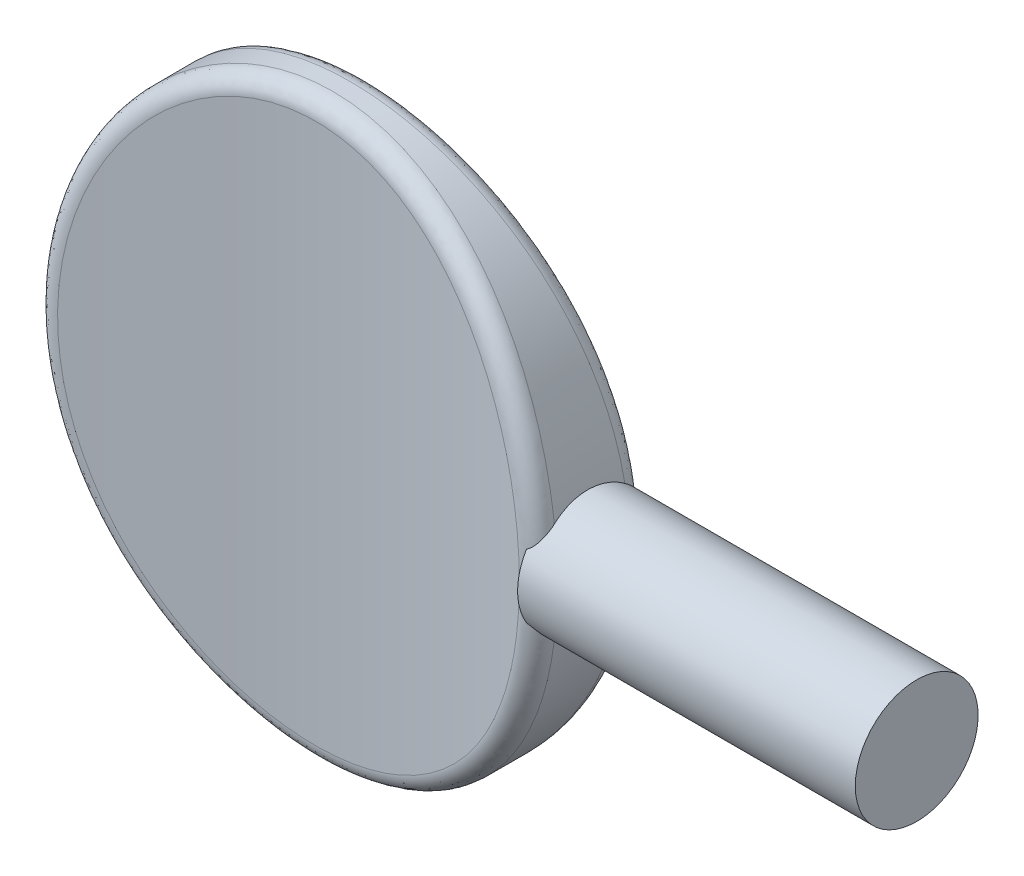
ISO-10303-21;
HEADER;
FILE_DESCRIPTION(('STEP AP214'),'2;1');
FILE_NAME('part.step','',(''),(''),'','','');
FILE_SCHEMA(('AUTOMOTIVE_DESIGN { 1 0 10303 214 1 1 1 1 }'));
ENDSEC;
DATA;
#1=APPLICATION_CONTEXT('core data for automotive mechanical design processes');
#2=APPLICATION_PROTOCOL_DEFINITION('international standard','automotive_design',2000,#1);
#3=PRODUCT_CONTEXT('',#1,'mechanical');
#4=PRODUCT('Part','Part','',(#3));
#5=PRODUCT_RELATED_PRODUCT_CATEGORY('part','',(#4));
#6=PRODUCT_DEFINITION_FORMATION('','',#4);
#7=PRODUCT_DEFINITION_CONTEXT('part definition',#1,'design');
#8=PRODUCT_DEFINITION('design','',#6,#7);
#9=PRODUCT_DEFINITION_SHAPE('','',#8);
#10=(LENGTH_UNIT() NAMED_UNIT(*) SI_UNIT(.MILLI.,.METRE.));
#11=(NAMED_UNIT(*) PLANE_ANGLE_UNIT() SI_UNIT($,.RADIAN.));
#12=(NAMED_UNIT(*) SI_UNIT($,.STERADIAN.) SOLID_ANGLE_UNIT());
#13=UNCERTAINTY_MEASURE_WITH_UNIT(LENGTH_MEASURE(1.E-05),#10,'distance_accuracy_value','');
#14=(GEOMETRIC_REPRESENTATION_CONTEXT(3) GLOBAL_UNCERTAINTY_ASSIGNED_CONTEXT((#13)) GLOBAL_UNIT_ASSIGNED_CONTEXT((#10,
#11,#12)) REPRESENTATION_CONTEXT('',''));
#15=CARTESIAN_POINT('',(0.,0.,0.));
#16=DIRECTION('',(0.,0.,1.));
#17=DIRECTION('',(1.,0.,0.));
#18=AXIS2_PLACEMENT_3D('',#15,#16,#17);
#19=CARTESIAN_POINT('',(0.,0.,2.286));
#20=DIRECTION('',(0.,0.,1.));
#21=DIRECTION('',(0.,-1.,0.));
#22=AXIS2_PLACEMENT_3D('',#19,#20,#21);
#23=ELLIPSE('',#22,11.303,9.906);
#24=DIRECTION('',(0.,0.,-1.));
#25=VECTOR('',#24,1.);
#26=SURFACE_OF_LINEAR_EXTRUSION('',#23,#25);
#27=CARTESIAN_POINT('',(9.7599834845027,-1.93354475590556,1.44359747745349));
#28=CARTESIAN_POINT('',(9.7538599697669,-1.97377990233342,1.3897162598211));
#29=CARTESIAN_POINT('',(9.74788480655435,-2.01176072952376,1.33413671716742));
#30=CARTESIAN_POINT('',(9.73639068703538,-2.08297198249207,1.21996586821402));
#31=CARTESIAN_POINT('',(9.73087174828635,-2.11620222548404,1.1613744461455));
#32=CARTESIAN_POINT('',(9.72044940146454,-2.17767139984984,1.04156116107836));
#33=CARTESIAN_POINT('',(9.71554607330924,-2.20590968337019,0.980338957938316));
#34=CARTESIAN_POINT('',(9.70649644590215,-2.25717945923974,0.855719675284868));
#35=CARTESIAN_POINT('',(9.70235011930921,-2.28021113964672,0.792322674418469));
#36=CARTESIAN_POINT('',(9.69123192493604,-2.34125083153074,0.599394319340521));
#37=CARTESIAN_POINT('',(9.68558076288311,-2.37120394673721,0.46712472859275));
#38=CARTESIAN_POINT('',(9.67850306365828,-2.40853619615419,0.199478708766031));
#39=CARTESIAN_POINT('',(9.67707378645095,-2.4159299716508,0.0641043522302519));
#40=CARTESIAN_POINT('',(9.67858617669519,-2.40802787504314,-0.204493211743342));
#41=CARTESIAN_POINT('',(9.68148053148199,-2.39297760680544,-0.33772381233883));
#42=CARTESIAN_POINT('',(9.6912194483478,-2.34108806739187,-0.599771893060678));
#43=CARTESIAN_POINT('',(9.69806554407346,-2.30424033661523,-0.728587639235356));
#44=CARTESIAN_POINT('',(9.7137074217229,-2.21664920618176,-0.960257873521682));
#45=CARTESIAN_POINT('',(9.72208273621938,-2.16865680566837,-1.06418600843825));
#46=CARTESIAN_POINT('',(9.73584734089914,-2.08614660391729,-1.21400793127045));
#47=CARTESIAN_POINT('',(9.74063407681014,-2.05690073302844,-1.26292205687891));
#48=CARTESIAN_POINT('',(9.7505120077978,-1.99503672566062,-1.35854295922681));
#49=CARTESIAN_POINT('',(9.7556032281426,-1.96241830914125,-1.40524955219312));
#50=CARTESIAN_POINT('',(9.76079800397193,-1.92818422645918,-1.45074966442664));
#51=B_SPLINE_CURVE_WITH_KNOTS('',3,(#27,#28,#29,#30,#31,#32,#33,#34,#35,#36,#37,#38,#39,#40,#41,
#42,#43,#44,#45,#46,#47,#48,#49,#50),.UNSPECIFIED.,.F.,.F.,(4,2,2,2,2,2,2,2,2,2,2,4),(0.,
0.202511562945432,0.405030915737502,0.607576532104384,0.810114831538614,1.2151884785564,
1.61999917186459,2.02041242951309,2.42098118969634,2.7640979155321,2.93554569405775,
3.10700772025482),.UNSPECIFIED.);
#52=CARTESIAN_POINT('',(9.75349384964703,-1.97571933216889,1.3853166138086));
#53=VERTEX_POINT('',#52);
#54=CARTESIAN_POINT('',(9.75349384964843,-1.97571933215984,-1.38531661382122));
#55=VERTEX_POINT('',#54);
#56=EDGE_CURVE('E64',#53,#55,#51,.T.);
#57=ORIENTED_EDGE('',*,*,#56,.F.);
#58=CARTESIAN_POINT('',(9.06433649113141,-0.441553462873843,2.07648141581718));
#59=CARTESIAN_POINT('',(9.89731087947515,-0.473374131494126,2.27409385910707));
#60=CARTESIAN_POINT('',(9.8975763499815,-0.466033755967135,1.41744012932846));
#61=CARTESIAN_POINT('',(9.04072988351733,-1.10521542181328,2.07087783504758));
#62=CARTESIAN_POINT('',(9.87118982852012,-1.18437600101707,2.26734926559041));
#63=CARTESIAN_POINT('',(9.87223120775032,-1.16650607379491,1.41173989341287));
#64=CARTESIAN_POINT('',(8.96387282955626,-1.76690913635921,2.05255322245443));
#65=CARTESIAN_POINT('',(9.78656612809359,-1.8914413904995,2.24540170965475));
#66=CARTESIAN_POINT('',(9.78972693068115,-1.86500634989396,1.39309920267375));
#67=CARTESIAN_POINT('',(8.70423897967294,-3.06740809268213,1.9926113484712));
#68=CARTESIAN_POINT('',(9.49942015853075,-3.28368426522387,2.17332598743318));
#69=CARTESIAN_POINT('',(9.5106965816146,-3.23896299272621,1.33212340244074));
#70=CARTESIAN_POINT('',(8.52144099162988,-3.70620872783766,1.95098942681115));
#71=CARTESIAN_POINT('',(9.29855203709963,-3.96503959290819,2.1236030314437));
#72=CARTESIAN_POINT('',(9.3141476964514,-3.9144147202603,1.28978355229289));
#73=CARTESIAN_POINT('',(8.0522372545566,-4.93844637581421,1.84970425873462));
#74=CARTESIAN_POINT('',(8.78113980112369,-5.28032485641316,2.00228764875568));
#75=CARTESIAN_POINT('',(8.8087223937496,-5.21927582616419,1.18675133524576));
#76=CARTESIAN_POINT('',(7.76638400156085,-5.53210522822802,1.79013749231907));
#77=CARTESIAN_POINT('',(8.46783563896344,-5.91194692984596,1.93136369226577));
#78=CARTESIAN_POINT('',(8.50044492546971,-5.84890960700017,1.12615711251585));
#79=CARTESIAN_POINT('',(7.26256698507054,-6.37458445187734,1.69306358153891));
#80=CARTESIAN_POINT('',(7.9123102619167,-6.81102173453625,1.81528163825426));
#81=CARTESIAN_POINT('',(7.95575827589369,-6.74427599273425,1.02740879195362));
#82=CARTESIAN_POINT('',(7.08198860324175,-6.64756129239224,1.65939540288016));
#83=CARTESIAN_POINT('',(7.71435000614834,-7.10090761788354,1.77525192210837));
#84=CARTESIAN_POINT('',(7.76033985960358,-7.03471301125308,0.993159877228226));
#85=CARTESIAN_POINT('',(6.69635721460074,-7.17472703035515,1.59067374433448));
#86=CARTESIAN_POINT('',(7.2916832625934,-7.66016806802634,1.69362011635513));
#87=CARTESIAN_POINT('',(7.34247562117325,-7.59625745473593,0.923252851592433));
#88=CARTESIAN_POINT('',(6.49131885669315,-7.42892702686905,1.55562110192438));
#89=CARTESIAN_POINT('',(7.06731807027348,-7.92959161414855,1.65205176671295));
#90=CARTESIAN_POINT('',(7.12004597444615,-7.86737629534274,0.88759559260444));
#91=CARTESIAN_POINT('',(6.07339660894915,-7.89779481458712,1.48797563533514));
#92=CARTESIAN_POINT('',(6.61001404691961,-8.42614113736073,1.5718945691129));
#93=CARTESIAN_POINT('',(6.66603588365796,-8.36809358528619,0.818783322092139));
#94=CARTESIAN_POINT('',(5.8621693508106,-8.11399325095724,1.45538942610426));
#95=CARTESIAN_POINT('',(6.37923621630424,-8.65490610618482,1.53333835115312));
#96=CARTESIAN_POINT('',(6.43629914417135,-8.59927776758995,0.785635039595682));
#97=CARTESIAN_POINT('',(5.420462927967,-8.52495389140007,1.39126982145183));
#98=CARTESIAN_POINT('',(5.89686229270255,-9.08924875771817,1.45756148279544));
#99=CARTESIAN_POINT('',(5.95522830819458,-9.03927334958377,0.720409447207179));
#100=CARTESIAN_POINT('',(5.18999529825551,-8.71972877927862,1.3597358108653));
#101=CARTESIAN_POINT('',(5.64541451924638,-9.2950474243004,1.42032518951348));
#102=CARTESIAN_POINT('',(5.70390714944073,-9.24809798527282,0.688331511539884));
#103=CARTESIAN_POINT('',(4.7112180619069,-9.08513182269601,1.29889201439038));
#104=CARTESIAN_POINT('',(5.12333296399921,-9.68063953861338,1.34857362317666));
#105=CARTESIAN_POINT('',(5.18108360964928,-9.64035101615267,0.626438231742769));
#106=CARTESIAN_POINT('',(4.46292238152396,-9.25577852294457,1.26958052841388));
#107=CARTESIAN_POINT('',(4.85275176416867,-9.86072624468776,1.31402128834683));
#108=CARTESIAN_POINT('',(4.9095969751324,-9.82379891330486,0.596621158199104));
#109=CARTESIAN_POINT('',(3.95012425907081,-9.5703567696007,1.21433232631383));
#110=CARTESIAN_POINT('',(4.29427737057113,-10.1922417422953,1.2489893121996));
#111=CARTESIAN_POINT('',(4.34815021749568,-10.1623803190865,0.540419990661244));
#112=CARTESIAN_POINT('',(3.68562512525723,-9.71429374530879,1.18839492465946));
#113=CARTESIAN_POINT('',(4.00630404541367,-10.3439928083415,1.21845738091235));
#114=CARTESIAN_POINT('',(4.05819386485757,-10.3175195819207,0.51403519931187));
#115=CARTESIAN_POINT('',(3.18095813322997,-9.95464296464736,1.14434912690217));
#116=CARTESIAN_POINT('',(3.45702558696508,-10.5971097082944,1.1666698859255));
#117=CARTESIAN_POINT('',(3.50428103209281,-10.5768490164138,0.469229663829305));
#118=CARTESIAN_POINT('',(2.94260311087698,-10.0548925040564,1.12565265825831));
#119=CARTESIAN_POINT('',(3.19771589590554,-10.7026948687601,1.14469031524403));
#120=CARTESIAN_POINT('',(3.2424065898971,-10.6851365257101,0.450210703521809));
#121=CARTESIAN_POINT('',(2.45745188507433,-10.2322329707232,1.09221652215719));
#122=CARTESIAN_POINT('',(2.67025548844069,-10.8892399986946,1.10543443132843));
#123=CARTESIAN_POINT('',(2.70890894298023,-10.8768424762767,0.416197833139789));
#124=CARTESIAN_POINT('',(2.21065722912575,-10.3093281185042,1.0774761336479));
#125=CARTESIAN_POINT('',(2.40189348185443,-10.9703962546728,1.08811890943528));
#126=CARTESIAN_POINT('',(2.43728752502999,-10.96026544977,0.401203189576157));
#127=CARTESIAN_POINT('',(1.71091716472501,-10.4390517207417,1.05249286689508));
#128=CARTESIAN_POINT('',(1.85884865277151,-11.1067770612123,1.05881030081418));
#129=CARTESIAN_POINT('',(1.88689681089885,-11.1007143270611,0.375788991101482));
#130=CARTESIAN_POINT('',(1.45797707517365,-10.4917005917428,1.04224623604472));
#131=CARTESIAN_POINT('',(1.58389234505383,-11.1621799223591,1.04677989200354));
#132=CARTESIAN_POINT('',(1.60813368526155,-11.1577622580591,0.365365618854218));
#133=CARTESIAN_POINT('',(0.948114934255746,-10.5716983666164,1.02661952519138));
#134=CARTESIAN_POINT('',(1.03003449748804,-11.2462512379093,1.0284575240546));
#135=CARTESIAN_POINT('',(1.04597206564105,-11.2444700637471,0.349469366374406));
#136=CARTESIAN_POINT('',(0.691193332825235,-10.5990501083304,1.02123889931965));
#137=CARTESIAN_POINT('',(0.75080259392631,-11.2750269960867,1.02214236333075));
#138=CARTESIAN_POINT('',(0.762574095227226,-11.2741330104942,0.343995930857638));
#139=CARTESIAN_POINT('',(0.209209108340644,-10.6261003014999,1.01591573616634));
#140=CARTESIAN_POINT('',(0.227293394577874,-11.3034522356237,1.01590196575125));
#141=CARTESIAN_POINT('',(0.23083451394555,-11.3034697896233,0.338580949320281));
#142=CARTESIAN_POINT('',(-0.0156831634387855,-10.6289136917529,1.0153606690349));
#143=CARTESIAN_POINT('',(-0.0170749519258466,-11.3064105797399,1.01525084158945));
#144=CARTESIAN_POINT('',(-0.0173081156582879,-11.3065216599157,0.338016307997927));
#145=CARTESIAN_POINT('',(-0.464932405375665,-10.6149527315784,1.01810993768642));
#146=CARTESIAN_POINT('',(-0.504998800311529,-11.2917412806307,1.0184735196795));
#147=CARTESIAN_POINT('',(-0.512964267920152,-11.291379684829,0.340812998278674));
#148=CARTESIAN_POINT('',(-0.689289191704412,-10.5981724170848,1.02141544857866));
#149=CARTESIAN_POINT('',(-0.748793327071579,-11.274092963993,1.02235186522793));
#150=CARTESIAN_POINT('',(-0.760477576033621,-11.2731793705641,0.344175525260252));
#151=CARTESIAN_POINT('',(-1.13556884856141,-10.5452601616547,1.0317883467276));
#152=CARTESIAN_POINT('',(-1.2335417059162,-11.2184912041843,1.03451259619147));
#153=CARTESIAN_POINT('',(-1.2526768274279,-11.2158123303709,0.354727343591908));
#154=CARTESIAN_POINT('',(-1.35749296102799,-10.5091386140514,1.03885371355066));
#155=CARTESIAN_POINT('',(-1.47472448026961,-11.1804953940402,1.04280421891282));
#156=CARTESIAN_POINT('',(-1.49736421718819,-11.1766568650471,0.361914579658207));
#157=CARTESIAN_POINT('',(-1.79749977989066,-10.4180266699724,1.05654330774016));
#158=CARTESIAN_POINT('',(-1.9527689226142,-11.0847276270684,1.06355029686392));
#159=CARTESIAN_POINT('',(-1.98226996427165,-11.0779503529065,0.379909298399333));
#160=CARTESIAN_POINT('',(-2.01558099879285,-10.3630291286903,1.06716888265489));
#161=CARTESIAN_POINT('',(-2.18983193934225,-11.0268610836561,1.07602492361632));
#162=CARTESIAN_POINT('',(-2.22248659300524,-11.0183915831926,0.390718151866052));
#163=CARTESIAN_POINT('',(-2.44049679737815,-10.2366111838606,1.09134888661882));
#164=CARTESIAN_POINT('',(-2.65162302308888,-10.8939375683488,1.10439715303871));
#165=CARTESIAN_POINT('',(-2.69022849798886,-10.8815920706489,0.415315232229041));
#166=CARTESIAN_POINT('',(-2.64747600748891,-10.1656759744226,1.10481618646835));
#167=CARTESIAN_POINT('',(-2.87668834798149,-10.8192776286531,1.12021587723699));
#168=CARTESIAN_POINT('',(-2.91792129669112,-10.8048739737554,0.429014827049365));
#169=CARTESIAN_POINT('',(-3.05512217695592,-10.0074393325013,1.13449174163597));
#170=CARTESIAN_POINT('',(-3.31994587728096,-10.6528031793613,1.15506402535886));
#171=CARTESIAN_POINT('',(-3.36602555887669,-10.6338821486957,0.459202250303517));
#172=CARTESIAN_POINT('',(-3.25578691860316,-9.92013222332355,1.15070094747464));
#173=CARTESIAN_POINT('',(-3.53825524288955,-10.5608636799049,1.17411805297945));
#174=CARTESIAN_POINT('',(-3.58643446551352,-10.5396023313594,0.47569104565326));
#175=CARTESIAN_POINT('',(-3.84654426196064,-9.63504101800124,1.20285461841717));
#176=CARTESIAN_POINT('',(-4.18237180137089,-10.2600882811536,1.2355487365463));
#177=CARTESIAN_POINT('',(-4.23476308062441,-10.2320328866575,0.528744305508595));
#178=CARTESIAN_POINT('',(-4.22571339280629,-9.41399224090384,1.24234388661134));
#179=CARTESIAN_POINT('',(-4.59539551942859,-10.0267310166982,1.28209163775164));
#180=CARTESIAN_POINT('',(-4.65012975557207,-9.99391046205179,0.568914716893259));
#181=CARTESIAN_POINT('',(-4.97579964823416,-8.89885031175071,1.3305459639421));
#182=CARTESIAN_POINT('',(-5.41315254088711,-9.48328684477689,1.38604753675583));
#183=CARTESIAN_POINT('',(-5.4703040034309,-9.44018886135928,0.658638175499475));
#184=CARTESIAN_POINT('',(-5.34372659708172,-8.60038202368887,1.37973973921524));
#185=CARTESIAN_POINT('',(-5.81438792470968,-9.16774150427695,1.44414433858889));
#186=CARTESIAN_POINT('',(-5.87171654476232,-9.11997166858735,0.708680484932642));
#187=CARTESIAN_POINT('',(-6.03184666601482,-7.95150761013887,1.4804681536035));
#188=CARTESIAN_POINT('',(-6.56597991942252,-8.48184990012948,1.56320931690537));
#189=CARTESIAN_POINT('',(-6.62102535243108,-8.42537982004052,0.811146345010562));
#190=CARTESIAN_POINT('',(-6.35201943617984,-7.60107946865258,1.53200377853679));
#191=CARTESIAN_POINT('',(-6.91576322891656,-8.11070576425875,1.62422932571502));
#192=CARTESIAN_POINT('',(-6.96889880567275,-8.05098220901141,0.863570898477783));
#193=CARTESIAN_POINT('',(-6.97998081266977,-6.80920807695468,1.63984325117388));
#194=CARTESIAN_POINT('',(-7.60405609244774,-7.27066586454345,1.75228632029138));
#195=CARTESIAN_POINT('',(-7.65003938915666,-7.20661845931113,0.973270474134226));
#196=CARTESIAN_POINT('',(-7.28060968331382,-6.36185596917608,1.69588343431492));
#197=CARTESIAN_POINT('',(-7.93313272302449,-6.79574608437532,1.81884441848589));
#198=CARTESIAN_POINT('',(-7.97537608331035,-6.73055907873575,1.03027728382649));
#199=CARTESIAN_POINT('',(-7.81370754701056,-5.42598150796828,1.8002849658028));
#200=CARTESIAN_POINT('',(-8.51893240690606,-5.80032940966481,1.94329479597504));
#201=CARTESIAN_POINT('',(-8.55143234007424,-5.73641613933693,1.13647961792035));
#202=CARTESIAN_POINT('',(-8.04612685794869,-4.93742947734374,1.84864070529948));
#203=CARTESIAN_POINT('',(-8.77401400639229,-5.2803139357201,2.00093018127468));
#204=CARTESIAN_POINT('',(-8.80209751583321,-5.21830229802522,1.18566943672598));
#205=CARTESIAN_POINT('',(-8.46579777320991,-3.86798278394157,1.93874221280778));
#206=CARTESIAN_POINT('',(-9.23695256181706,-4.13843974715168,2.10886875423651));
#207=CARTESIAN_POINT('',(-9.25424841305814,-4.08562792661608,1.27732508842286));
#208=CARTESIAN_POINT('',(-8.6437754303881,-3.28317788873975,1.97890682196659));
#209=CARTESIAN_POINT('',(-9.43263150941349,-3.5145810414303,2.15687234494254));
#210=CARTESIAN_POINT('',(-9.4456739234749,-3.46710594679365,1.31818248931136));
#211=CARTESIAN_POINT('',(-8.90988228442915,-2.09221318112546,2.03992221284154));
#212=CARTESIAN_POINT('',(-9.72684753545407,-2.24001917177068,2.2302091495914));
#213=CARTESIAN_POINT('',(-9.73173019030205,-2.20856660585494,1.38025032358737));
#214=CARTESIAN_POINT('',(-8.99807319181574,-1.48606833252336,2.06078625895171));
#215=CARTESIAN_POINT('',(-9.82401541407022,-1.59219662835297,2.25521159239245));
#216=CARTESIAN_POINT('',(-9.82642742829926,-1.56856432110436,1.40147425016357));
#217=CARTESIAN_POINT('',(-9.07155097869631,-0.448175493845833,2.07818799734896));
#218=CARTESIAN_POINT('',(-9.90531304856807,-0.480096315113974,2.27615280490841));
#219=CARTESIAN_POINT('',(-9.9053231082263,-0.472998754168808,1.41917614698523));
#220=CARTESIAN_POINT('',(-9.07960069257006,-0.0180241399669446,2.08010539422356));
#221=CARTESIAN_POINT('',(-9.91421749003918,-0.0195018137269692,2.2784597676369));
#222=CARTESIAN_POINT('',(-9.91396460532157,-0.0190320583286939,1.42112661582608));
#223=CARTESIAN_POINT('',(-9.05114135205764,0.840874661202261,2.07334832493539));
#224=CARTESIAN_POINT('',(-9.8827087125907,0.901272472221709,2.27032260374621));
#225=CARTESIAN_POINT('',(-9.88340958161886,0.887501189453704,1.41425299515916));
#226=CARTESIAN_POINT('',(-9.01462354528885,1.26962181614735,2.06467177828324));
#227=CARTESIAN_POINT('',(-9.84236732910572,1.36026082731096,2.25989703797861));
#228=CARTESIAN_POINT('',(-9.84420366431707,1.34006744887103,1.40542678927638));
#229=CARTESIAN_POINT('',(-8.90937536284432,2.0316986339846,2.0400225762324));
#230=CARTESIAN_POINT('',(-9.72583784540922,2.17696234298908,2.23022004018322));
#231=CARTESIAN_POINT('',(-9.73114985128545,2.14477756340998,1.38035241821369));
#232=CARTESIAN_POINT('',(-8.8489354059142,2.3663077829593,2.02594526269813));
#233=CARTESIAN_POINT('',(-9.65907544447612,2.53501090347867,2.21331194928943));
#234=CARTESIAN_POINT('',(-9.66621476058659,2.49821035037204,1.3660322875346));
#235=CARTESIAN_POINT('',(-8.70028670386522,3.02889346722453,1.99186677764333));
#236=CARTESIAN_POINT('',(-9.49474440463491,3.24406808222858,2.17235903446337));
#237=CARTESIAN_POINT('',(-9.50642120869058,3.19839647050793,1.33136598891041));
#238=CARTESIAN_POINT('',(-8.61207087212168,3.35686828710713,1.97186409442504));
#239=CARTESIAN_POINT('',(-9.39741618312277,3.59458478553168,2.14837201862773));
#240=CARTESIAN_POINT('',(-9.41155511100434,3.54514807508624,1.31101828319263));
#241=CARTESIAN_POINT('',(-8.40792982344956,4.00383954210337,1.92654702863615));
#242=CARTESIAN_POINT('',(-9.17207272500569,4.28589025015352,2.09402079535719));
#243=CARTESIAN_POINT('',(-9.19186339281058,4.22959703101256,1.26491955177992));
#244=CARTESIAN_POINT('',(-8.29197010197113,4.32282423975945,1.90122603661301));
#245=CARTESIAN_POINT('',(-9.04433751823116,4.62626387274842,2.06371975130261));
#246=CARTESIAN_POINT('',(-9.06700046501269,4.56728252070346,1.2391618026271));
#247=CARTESIAN_POINT('',(-8.03266921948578,4.94864016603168,1.84612445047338));
#248=CARTESIAN_POINT('',(-8.75862164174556,5.29375063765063,1.9977928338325));
#249=CARTESIAN_POINT('',(-8.7875357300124,5.23032676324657,1.18310977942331));
#250=CARTESIAN_POINT('',(-7.88933080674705,5.25547261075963,1.8163443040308));
#251=CARTESIAN_POINT('',(-8.60101160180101,5.6205680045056,1.96224124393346));
#252=CARTESIAN_POINT('',(-8.63293690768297,5.55568674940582,1.1528159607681));
#253=CARTESIAN_POINT('',(-7.5827057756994,5.84065532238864,1.75476032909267));
#254=CARTESIAN_POINT('',(-8.26377031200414,6.24355498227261,1.88874534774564));
#255=CARTESIAN_POINT('',(-8.30186425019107,6.1768129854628,1.09016973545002));
#256=CARTESIAN_POINT('',(-7.42060725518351,6.11966595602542,1.72310789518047));
#257=CARTESIAN_POINT('',(-8.08585157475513,6.54018510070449,1.85105198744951));
#258=CARTESIAN_POINT('',(-8.12668803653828,6.47325210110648,1.05797133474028));
#259=CARTESIAN_POINT('',(-7.07231803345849,6.66122664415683,1.65771330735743));
#260=CARTESIAN_POINT('',(-7.70361694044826,7.11546435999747,1.77323427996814));
#261=CARTESIAN_POINT('',(-7.74985395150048,7.04926217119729,0.991448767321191));
#262=CARTESIAN_POINT('',(-6.88614017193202,6.92378536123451,1.62397227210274));
#263=CARTESIAN_POINT('',(-7.49964582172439,7.39408379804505,1.73315517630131));
#264=CARTESIAN_POINT('',(-7.54821019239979,7.3288419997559,0.957125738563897));
#265=CARTESIAN_POINT('',(-6.49029818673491,7.42975304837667,1.55555294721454));
#266=CARTESIAN_POINT('',(-7.06608461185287,7.93046508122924,1.65196090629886));
#267=CARTESIAN_POINT('',(-7.11892134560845,7.86825729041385,0.887526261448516));
#268=CARTESIAN_POINT('',(-6.2806366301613,7.67316410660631,1.52087476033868));
#269=CARTESIAN_POINT('',(-6.83678956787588,8.1883058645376,1.6108692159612));
#270=CARTESIAN_POINT('',(-6.89127909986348,8.12809490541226,0.852249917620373));
#271=CARTESIAN_POINT('',(-5.8388607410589,8.13772708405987,1.45187677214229));
#272=CARTESIAN_POINT('',(-6.35382230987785,8.67984460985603,1.52920305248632));
#273=CARTESIAN_POINT('',(-6.41093575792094,8.624649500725,0.782061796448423));
#274=CARTESIAN_POINT('',(-5.60676139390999,8.35889366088,1.417556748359));
#275=CARTESIAN_POINT('',(-6.10038934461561,8.91374416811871,1.48862685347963));
#276=CARTESIAN_POINT('',(-6.15825138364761,8.86138170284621,0.747149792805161));
#277=CARTESIAN_POINT('',(-5.14547789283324,8.75521824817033,1.35394959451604));
#278=CARTESIAN_POINT('',(-5.59675257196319,9.33250836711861,1.41349407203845));
#279=CARTESIAN_POINT('',(-5.65531654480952,9.28616485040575,0.68244549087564));
#280=CARTESIAN_POINT('',(-4.91829844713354,8.9327643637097,1.32450134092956));
#281=CARTESIAN_POINT('',(-5.34900946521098,9.5200007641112,1.37874615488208));
#282=CARTESIAN_POINT('',(-5.40732214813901,9.47671576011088,0.652489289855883));
#283=CARTESIAN_POINT('',(-4.44814344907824,9.26490654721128,1.26802841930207));
#284=CARTESIAN_POINT('',(-4.8365814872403,9.87031362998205,1.31219664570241));
#285=CARTESIAN_POINT('',(-4.89341430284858,9.833611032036,0.595042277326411));
#286=CARTESIAN_POINT('',(-4.20517788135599,9.41951692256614,1.24100224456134));
#287=CARTESIAN_POINT('',(-4.57190339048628,10.0334050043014,1.28035681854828));
#288=CARTESIAN_POINT('',(-4.62751217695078,9.99997048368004,0.56754993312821));
#289=CARTESIAN_POINT('',(-3.7052575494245,9.7034163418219,1.1903933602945));
#290=CARTESIAN_POINT('',(-4.02765051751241,10.332475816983,1.22081747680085));
#291=CARTESIAN_POINT('',(-4.07971355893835,10.3057842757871,0.516068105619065));
#292=CARTESIAN_POINT('',(-3.44831525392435,9.83272749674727,1.16680764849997));
#293=CARTESIAN_POINT('',(-3.74797965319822,10.4687607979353,1.19306613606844));
#294=CARTESIAN_POINT('',(-3.79783131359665,10.4452621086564,0.492075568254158));
#295=CARTESIAN_POINT('',(-2.92242796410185,10.0639380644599,1.12400959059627));
#296=CARTESIAN_POINT('',(-3.17597688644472,10.7120881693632,1.14278503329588));
#297=CARTESIAN_POINT('',(-3.22025584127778,10.6948915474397,0.448539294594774));
#298=CARTESIAN_POINT('',(-2.65348535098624,10.1658428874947,1.10479638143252));
#299=CARTESIAN_POINT('',(-2.88342317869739,10.8194170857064,1.12020062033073));
#300=CARTESIAN_POINT('',(-2.92456535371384,10.8050489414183,0.428994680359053));
#301=CARTESIAN_POINT('',(-2.14710069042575,10.3272733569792,1.07404899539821));
#302=CARTESIAN_POINT('',(-2.33284413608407,10.9892348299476,1.08410380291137));
#303=CARTESIAN_POINT('',(-2.36731608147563,10.9796823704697,0.39771693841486));
#304=CARTESIAN_POINT('',(-1.91094499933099,10.3908533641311,1.06179682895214));
#305=CARTESIAN_POINT('',(-2.0761007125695,11.0561454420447,1.06971620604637));
#306=CARTESIAN_POINT('',(-2.10724644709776,11.0485217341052,0.385253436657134));
#307=CARTESIAN_POINT('',(-1.43374613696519,10.4958098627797,1.04145662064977));
#308=CARTESIAN_POINT('',(-1.55762642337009,11.1664699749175,1.04586002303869));
#309=CARTESIAN_POINT('',(-1.5814284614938,11.162210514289,0.364562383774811));
#310=CARTESIAN_POINT('',(-1.1927036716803,10.5371895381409,1.03336798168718));
#311=CARTESIAN_POINT('',(-1.295640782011,11.2100047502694,1.03636574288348));
#312=CARTESIAN_POINT('',(-1.31568093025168,11.2070633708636,0.356334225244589));
#313=CARTESIAN_POINT('',(-0.707915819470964,10.5970726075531,1.02163323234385));
#314=CARTESIAN_POINT('',(-0.769059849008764,11.2729324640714,1.02260821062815));
#315=CARTESIAN_POINT('',(-0.781028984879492,11.2719859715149,0.344397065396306));
#316=CARTESIAN_POINT('',(-0.464172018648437,10.6155887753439,1.01798464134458));
#317=CARTESIAN_POINT('',(-0.504175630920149,11.2924099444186,1.01832657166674));
#318=CARTESIAN_POINT('',(-0.512126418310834,11.2920695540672,0.340685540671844));
#319=CARTESIAN_POINT('',(0.0239742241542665,10.6294808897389,1.01524901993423));
#320=CARTESIAN_POINT('',(0.0259922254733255,11.3070062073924,1.01512004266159));
#321=CARTESIAN_POINT('',(0.0264470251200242,11.3071368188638,0.337902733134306));
#322=CARTESIAN_POINT('',(0.268376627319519,10.6248581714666,1.01616172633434));
#323=CARTESIAN_POINT('',(0.291583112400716,11.3021433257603,1.01619112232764));
#324=CARTESIAN_POINT('',(0.296117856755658,11.3021219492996,0.338831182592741));
#325=CARTESIAN_POINT('',(0.731015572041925,10.5941897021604,1.02219342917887));
#326=CARTESIAN_POINT('',(0.794042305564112,11.2699210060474,1.02326107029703));
#327=CARTESIAN_POINT('',(0.806497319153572,11.2688626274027,0.344966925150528));
#328=CARTESIAN_POINT('',(0.949402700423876,10.5703538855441,1.02687846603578));
#329=CARTESIAN_POINT('',(1.03135419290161,11.244851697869,1.02875824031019));
#330=CARTESIAN_POINT('',(1.04738130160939,11.2430144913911,0.34973277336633));
#331=CARTESIAN_POINT('',(1.38344630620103,10.5043595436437,1.03977653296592));
#332=CARTESIAN_POINT('',(1.50284665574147,11.1754967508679,1.04388124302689));
#333=CARTESIAN_POINT('',(1.52596681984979,11.1714816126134,0.362853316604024));
#334=CARTESIAN_POINT('',(1.59910191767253,10.4621953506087,1.04799065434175));
#335=CARTESIAN_POINT('',(1.73723082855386,11.1311427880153,1.053521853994));
#336=CARTESIAN_POINT('',(1.76366734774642,11.1257907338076,0.371209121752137));
#337=CARTESIAN_POINT('',(2.02606245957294,10.3600924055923,1.06772057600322));
#338=CARTESIAN_POINT('',(2.20115032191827,11.0238097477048,1.07666464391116));
#339=CARTESIAN_POINT('',(2.23402228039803,11.0152178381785,0.39127936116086));
#340=CARTESIAN_POINT('',(2.23736912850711,10.3001609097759,1.0792350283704));
#341=CARTESIAN_POINT('',(2.43086687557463,10.9607473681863,1.09018446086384));
#342=CARTESIAN_POINT('',(2.46667870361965,10.9503436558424,0.402992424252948));
#343=CARTESIAN_POINT('',(2.65441619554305,10.1632551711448,1.10525920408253));
#344=CARTESIAN_POINT('',(2.88420079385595,10.8167652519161,1.12072955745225));
#345=CARTESIAN_POINT('',(2.92555248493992,10.8022616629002,0.429465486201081));
#346=CARTESIAN_POINT('',(2.86015443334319,10.0862744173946,1.11977007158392));
#347=CARTESIAN_POINT('',(3.10796098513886,10.7357272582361,1.13777888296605));
#348=CARTESIAN_POINT('',(3.15176734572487,10.7190468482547,0.444226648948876));
#349=CARTESIAN_POINT('',(3.47229190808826,9.82882926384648,1.16766697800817));
#350=CARTESIAN_POINT('',(3.77502068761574,10.4642750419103,1.19415299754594));
#351=CARTESIAN_POINT('',(3.82428787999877,10.4410018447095,0.492949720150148));
#352=CARTESIAN_POINT('',(3.8683972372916,9.62312725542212,1.20516354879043));
#353=CARTESIAN_POINT('',(4.20637914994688,10.2471702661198,1.23832898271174));
#354=CARTESIAN_POINT('',(4.25872054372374,10.2191448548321,0.531093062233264));
#355=CARTESIAN_POINT('',(4.62459293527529,9.15366768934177,1.28740400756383));
#356=CARTESIAN_POINT('',(5.03001761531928,9.75240293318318,1.33514205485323));
#357=CARTESIAN_POINT('',(5.08654839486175,9.71393277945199,0.614752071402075));
#358=CARTESIAN_POINT('',(4.9846713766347,8.88989099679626,1.33215028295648));
#359=CARTESIAN_POINT('',(5.42252640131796,9.47370233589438,1.38794594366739));
#360=CARTESIAN_POINT('',(5.47992999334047,9.43055742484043,0.660270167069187));
#361=CARTESIAN_POINT('',(5.69889695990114,8.28317315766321,1.42989181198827));
#362=CARTESIAN_POINT('',(6.20241802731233,8.83257556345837,1.50340477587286));
#363=CARTESIAN_POINT('',(6.25876561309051,8.78017530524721,0.759697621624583));
#364=CARTESIAN_POINT('',(6.04858866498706,7.93486893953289,1.48326169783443));
#365=CARTESIAN_POINT('',(6.5841873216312,8.46389482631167,1.56654004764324));
#366=CARTESIAN_POINT('',(6.63920256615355,8.40755316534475,0.813988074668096));
#367=CARTESIAN_POINT('',(6.69355774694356,7.18955442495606,1.58930188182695));
#368=CARTESIAN_POINT('',(7.28996031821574,7.6745484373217,1.69221318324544));
#369=CARTESIAN_POINT('',(7.33958984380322,7.61192292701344,0.921857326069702));
#370=CARTESIAN_POINT('',(6.98880792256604,6.79251994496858,1.64197181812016));
#371=CARTESIAN_POINT('',(7.61298151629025,7.25337948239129,1.7547092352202));
#372=CARTESIAN_POINT('',(7.65950993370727,7.18888981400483,0.975435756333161));
#373=CARTESIAN_POINT('',(7.55852416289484,5.9035257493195,1.74907555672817));
#374=CARTESIAN_POINT('',(8.23879298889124,6.30821299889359,1.88227557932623));
#375=CARTESIAN_POINT('',(8.27589606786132,6.24338332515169,1.08438690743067));
#376=CARTESIAN_POINT('',(7.82473612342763,5.40599546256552,1.80277922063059));
#377=CARTESIAN_POINT('',(8.53065041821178,5.77912309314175,1.94620221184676));
#378=CARTESIAN_POINT('',(8.56329170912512,5.71520536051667,1.13901689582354));
#379=CARTESIAN_POINT('',(8.2814684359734,4.37513696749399,1.89847802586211));
#380=CARTESIAN_POINT('',(9.03367283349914,4.68015804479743,2.06063032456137));
#381=CARTESIAN_POINT('',(9.0557691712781,4.62251452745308,1.23636639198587));
#382=CARTESIAN_POINT('',(8.47195257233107,3.84179177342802,1.94046756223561));
#383=CARTESIAN_POINT('',(9.24305355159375,4.11150478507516,2.11078670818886));
#384=CARTESIAN_POINT('',(9.26081160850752,4.05798442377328,1.27908019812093));
#385=CARTESIAN_POINT('',(8.79277988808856,2.69157447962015,2.01267902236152));
#386=CARTESIAN_POINT('',(9.59762062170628,2.88109997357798,2.19751575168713));
#387=CARTESIAN_POINT('',(9.60591371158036,2.8417227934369,1.35253722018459));
#388=CARTESIAN_POINT('',(8.91415781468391,2.07198286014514,2.04108919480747));
#389=CARTESIAN_POINT('',(9.7312231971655,2.21931200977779,2.23152481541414));
#390=CARTESIAN_POINT('',(9.73629583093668,2.1872462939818,1.38143743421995));
#391=CARTESIAN_POINT('',(9.06115860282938,0.820487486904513,2.07565423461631));
#392=CARTESIAN_POINT('',(9.89394740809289,0.878268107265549,2.27313745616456));
#393=CARTESIAN_POINT('',(9.89417614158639,0.8659119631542,1.41659868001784));
#394=CARTESIAN_POINT('',(9.08675047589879,0.188579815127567,2.08180189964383));
#395=CARTESIAN_POINT('',(9.92214545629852,0.202610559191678,2.28050627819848));
#396=CARTESIAN_POINT('',(9.92164103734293,0.199050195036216,1.42285238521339));
#397=CARTESIAN_POINT('',(9.06433649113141,-0.441553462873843,2.07648141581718));
#398=CARTESIAN_POINT('',(9.89731087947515,-0.473374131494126,2.27409385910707));
#399=CARTESIAN_POINT('',(9.8975763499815,-0.466033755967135,1.41744012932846));
#400=(BOUNDED_SURFACE() B_SPLINE_SURFACE(3,2,((#58,#59,#60),(#61,#62,#63),(#64,#65,#66),(#67,
#68,#69),(#70,#71,#72),(#73,#74,#75),(#76,#77,#78),(#79,#80,#81),(#82,#83,#84),(#85,#86,#87),
(#88,#89,#90),(#91,#92,#93),(#94,#95,#96),(#97,#98,#99),(#100,#101,#102),(#103,#104,#105),(#106,
#107,#108),(#109,#110,#111),(#112,#113,#114),(#115,#116,#117),(#118,#119,#120),(#121,#122,#123),
(#124,#125,#126),(#127,#128,#129),(#130,#131,#132),(#133,#134,#135),(#136,#137,#138),(#139,#140,
#141),(#142,#143,#144),(#145,#146,#147),(#148,#149,#150),(#151,#152,#153),(#154,#155,#156),
(#157,#158,#159),(#160,#161,#162),(#163,#164,#165),(#166,#167,#168),(#169,#170,#171),(#172,#173,
#174),(#175,#176,#177),(#178,#179,#180),(#181,#182,#183),(#184,#185,#186),(#187,#188,#189),
(#190,#191,#192),(#193,#194,#195),(#196,#197,#198),(#199,#200,#201),(#202,#203,#204),(#205,#206,
#207),(#208,#209,#210),(#211,#212,#213),(#214,#215,#216),(#217,#218,#219),(#220,#221,#222),
(#223,#224,#225),(#226,#227,#228),(#229,#230,#231),(#232,#233,#234),(#235,#236,#237),(#238,#239,
#240),(#241,#242,#243),(#244,#245,#246),(#247,#248,#249),(#250,#251,#252),(#253,#254,#255),
(#256,#257,#258),(#259,#260,#261),(#262,#263,#264),(#265,#266,#267),(#268,#269,#270),(#271,#272,
#273),(#274,#275,#276),(#277,#278,#279),(#280,#281,#282),(#283,#284,#285),(#286,#287,#288),
(#289,#290,#291),(#292,#293,#294),(#295,#296,#297),(#298,#299,#300),(#301,#302,#303),(#304,#305,
#306),(#307,#308,#309),(#310,#311,#312),(#313,#314,#315),(#316,#317,#318),(#319,#320,#321),
(#322,#323,#324),(#325,#326,#327),(#328,#329,#330),(#331,#332,#333),(#334,#335,#336),(#337,#338,
#339),(#340,#341,#342),(#343,#344,#345),(#346,#347,#348),(#349,#350,#351),(#352,#353,#354),
(#355,#356,#357),(#358,#359,#360),(#361,#362,#363),(#364,#365,#366),(#367,#368,#369),(#370,#371,
#372),(#373,#374,#375),(#376,#377,#378),(#379,#380,#381),(#382,#383,#384),(#385,#386,#387),
(#388,#389,#390),(#391,#392,#393),(#394,#395,#396),(#397,#398,#399)),.UNSPECIFIED.,.T.,.F.,
.F.) B_SPLINE_SURFACE_WITH_KNOTS((4,2,2,2,2,2,2,2,2,2,2,2,2,2,2,2,2,2,2,2,2,2,2,2,2,2,2,2,2,2,2,
2,2,2,2,2,2,2,2,2,2,2,2,2,2,2,2,2,2,2,2,2,2,2,2,2,4),(3,3),(0.,1.99013383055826,
3.98066589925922,5.9606813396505,6.95189992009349,7.94252781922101,8.86106937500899,
9.77906414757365,10.6963494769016,11.6134481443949,12.4015093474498,13.1894268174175,
13.9766850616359,14.7638549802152,15.4493720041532,16.135097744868,16.8204553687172,
17.5060726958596,18.1731188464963,18.8403967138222,20.1739641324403,21.6123317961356,
23.0513106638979,24.6794364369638,26.3087451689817,28.1416611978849,29.9733166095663,
31.2617105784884,32.5503576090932,33.5706861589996,34.5912752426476,35.6131402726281,
36.6349027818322,37.6106807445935,38.5859405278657,39.5610938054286,40.5356002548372,
41.4132125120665,42.2902749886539,43.1665674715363,44.0426868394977,44.7880998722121,
45.5334059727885,46.2782954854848,47.0231420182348,47.6927906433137,48.3626464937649,
49.0322291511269,49.7020679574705,51.0579388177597,52.4142570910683,53.9106893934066,
55.4078673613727,57.1081651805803,58.8092751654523,60.6982549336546,62.5878457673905),(0.,1.),
.UNSPECIFIED.) GEOMETRIC_REPRESENTATION_ITEM() RATIONAL_B_SPLINE_SURFACE(((1.,0.620209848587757,
1.),(1.,0.620635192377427,1.),(1.,0.622024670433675,1.),(1.,0.626603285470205,1.),(1.,
0.629792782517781,1.),(1.,0.637645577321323,1.),(1.,0.642300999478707,1.),(1.,0.650003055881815,
1.),(1.,0.652692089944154,1.),(1.,0.658224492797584,1.),(1.,0.661067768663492,1.),(1.,
0.666601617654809,1.),(1.,0.669288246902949,1.),(1.,0.674617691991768,1.),(1.,0.677260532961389,
1.),(1.,0.682400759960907,1.),(1.,0.684898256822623,1.),(1.,0.689641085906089,1.),(1.,
0.691886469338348,1.),(1.,0.69572436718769,1.),(1.,0.697364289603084,1.),(1.,0.700310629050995,
1.),(1.,0.701617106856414,1.),(1.,0.703838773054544,1.),(1.,0.704754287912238,1.),(1.,
0.706152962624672,1.),(1.,0.706636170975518,1.),(1.,0.707114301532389,1.),(1.,0.707164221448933,
1.),(1.,0.706917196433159,1.),(1.,0.706620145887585,1.),(1.,0.705690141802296,1.),(1.,
0.705057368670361,1.),(1.,0.703478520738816,1.),(1.,0.702532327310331,1.),(1.,0.700388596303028,
1.),(1.,0.699198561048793,1.),(1.,0.69658926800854,1.),(1.,0.695169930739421,1.),(1.,
0.690628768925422,1.),(1.,0.687222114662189,1.),(1.,0.679710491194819,1.),(1.,0.675571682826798,
1.),(1.,0.667208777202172,1.),(1.,0.662984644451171,1.),(1.,0.654247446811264,1.),(1.,
0.649769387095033,1.),(1.,0.641511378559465,1.),(1.,0.637731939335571,1.),(1.,0.630738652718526,
1.),(1.,0.627654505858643,1.),(1.,0.62298655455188,1.),(1.,0.621401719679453,1.),(1.,
0.620080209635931,1.),(1.,0.619934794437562,1.),(1.,0.620447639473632,1.),(1.,0.621106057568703,
1.),(1.,0.622982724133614,1.),(1.,0.624055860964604,1.),(1.,0.62666300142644,1.),(1.,
0.628197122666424,1.),(1.,0.63168899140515,1.),(1.,0.633647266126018,1.),(1.,0.637933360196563,
1.),(1.,0.640261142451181,1.),(1.,0.645107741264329,1.),(1.,0.647613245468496,1.),(1.,
0.652827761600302,1.),(1.,0.655536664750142,1.),(1.,0.661073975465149,1.),(1.,0.663902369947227,
1.),(1.,0.669577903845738,1.),(1.,0.672425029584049,1.),(1.,0.677747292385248,1.),(1.,
0.68023126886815,1.),(1.,0.685030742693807,1.),(1.,0.687346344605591,1.),(1.,0.691712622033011,
1.),(1.,0.693763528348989,1.),(1.,0.697507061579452,1.),(1.,0.699199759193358,1.),(1.,
0.701920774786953,1.),(1.,0.703010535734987,1.),(1.,0.70482443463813,1.),(1.,0.705548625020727,
1.),(1.,0.706600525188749,1.),(1.,0.706928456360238,1.),(1.,0.707174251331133,1.),(1.,
0.707092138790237,1.),(1.,0.706550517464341,1.),(1.,0.706129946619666,1.),(1.,0.704975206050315,
1.),(1.,0.704240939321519,1.),(1.,0.702483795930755,1.),(1.,0.701461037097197,1.),(1.,
0.699159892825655,1.),(1.,0.697881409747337,1.),(1.,0.693683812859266,1.),(1.,0.690425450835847,
1.),(1.,0.683371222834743,1.),(1.,0.679575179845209,1.),(1.,0.671389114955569,1.),(1.,
0.666978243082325,1.),(1.,0.658324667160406,1.),(1.,0.654082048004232,1.),(1.,0.645543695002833,
1.),(1.,0.641318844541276,1.),(1.,0.633852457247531,1.),(1.,0.630611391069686,1.),(1.,
0.625064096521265,1.),(1.,0.622900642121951,1.),(1.,0.620271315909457,1.),(1.,0.619805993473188,
1.),(1.,0.620209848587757,1.))) REPRESENTATION_ITEM('') SURFACE());
#401=CARTESIAN_POINT('',(9.8975763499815,-0.466033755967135,1.41744012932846));
#402=CARTESIAN_POINT('',(9.87223120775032,-1.16650607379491,1.41173989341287));
#403=CARTESIAN_POINT('',(9.78972693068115,-1.86500634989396,1.39309920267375));
#404=CARTESIAN_POINT('',(9.5106965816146,-3.23896299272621,1.33212340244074));
#405=CARTESIAN_POINT('',(9.3141476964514,-3.9144147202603,1.28978355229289));
#406=CARTESIAN_POINT('',(8.8087223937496,-5.21927582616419,1.18675133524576));
#407=CARTESIAN_POINT('',(8.50044492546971,-5.84890960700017,1.12615711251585));
#408=CARTESIAN_POINT('',(7.95575827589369,-6.74427599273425,1.02740879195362));
#409=CARTESIAN_POINT('',(7.76033985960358,-7.03471301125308,0.993159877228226));
#410=CARTESIAN_POINT('',(7.34247562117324,-7.59625745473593,0.923252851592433));
#411=CARTESIAN_POINT('',(7.12004597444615,-7.86737629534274,0.88759559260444));
#412=CARTESIAN_POINT('',(6.66603588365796,-8.36809358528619,0.818783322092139));
#413=CARTESIAN_POINT('',(6.43629914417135,-8.59927776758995,0.785635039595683));
#414=CARTESIAN_POINT('',(5.95522830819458,-9.03927334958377,0.720409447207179));
#415=CARTESIAN_POINT('',(5.70390714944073,-9.24809798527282,0.688331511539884));
#416=CARTESIAN_POINT('',(5.18108360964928,-9.64035101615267,0.626438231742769));
#417=CARTESIAN_POINT('',(4.9095969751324,-9.82379891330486,0.596621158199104));
#418=CARTESIAN_POINT('',(4.34815021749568,-10.1623803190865,0.540419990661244));
#419=CARTESIAN_POINT('',(4.05819386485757,-10.3175195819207,0.51403519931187));
#420=CARTESIAN_POINT('',(3.50428103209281,-10.5768490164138,0.469229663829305));
#421=CARTESIAN_POINT('',(3.2424065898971,-10.6851365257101,0.450210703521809));
#422=CARTESIAN_POINT('',(2.70890894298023,-10.8768424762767,0.416197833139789));
#423=CARTESIAN_POINT('',(2.43728752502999,-10.96026544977,0.401203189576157));
#424=CARTESIAN_POINT('',(1.88689681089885,-11.1007143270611,0.375788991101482));
#425=CARTESIAN_POINT('',(1.60813368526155,-11.1577622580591,0.365365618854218));
#426=CARTESIAN_POINT('',(1.04597206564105,-11.2444700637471,0.349469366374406));
#427=CARTESIAN_POINT('',(0.762574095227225,-11.2741330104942,0.343995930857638));
#428=CARTESIAN_POINT('',(0.23083451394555,-11.3034697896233,0.338580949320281));
#429=CARTESIAN_POINT('',(-0.0173081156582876,-11.3065216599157,0.338016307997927));
#430=CARTESIAN_POINT('',(-0.512964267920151,-11.291379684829,0.340812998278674));
#431=CARTESIAN_POINT('',(-0.760477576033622,-11.2731793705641,0.344175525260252));
#432=CARTESIAN_POINT('',(-1.2526768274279,-11.2158123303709,0.354727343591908));
#433=CARTESIAN_POINT('',(-1.49736421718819,-11.1766568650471,0.361914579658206));
#434=CARTESIAN_POINT('',(-1.98226996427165,-11.0779503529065,0.379909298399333));
#435=CARTESIAN_POINT('',(-2.22248659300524,-11.0183915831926,0.390718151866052));
#436=CARTESIAN_POINT('',(-2.69022849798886,-10.8815920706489,0.415315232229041));
#437=CARTESIAN_POINT('',(-2.91792129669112,-10.8048739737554,0.429014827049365));
#438=CARTESIAN_POINT('',(-3.36602555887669,-10.6338821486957,0.459202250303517));
#439=CARTESIAN_POINT('',(-3.58643446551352,-10.5396023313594,0.47569104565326));
#440=CARTESIAN_POINT('',(-4.23476308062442,-10.2320328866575,0.528744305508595));
#441=CARTESIAN_POINT('',(-4.65012975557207,-9.99391046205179,0.568914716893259));
#442=CARTESIAN_POINT('',(-5.4703040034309,-9.44018886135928,0.658638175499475));
#443=CARTESIAN_POINT('',(-5.87171654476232,-9.11997166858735,0.708680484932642));
#444=CARTESIAN_POINT('',(-6.62102535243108,-8.42537982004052,0.811146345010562));
#445=CARTESIAN_POINT('',(-6.96889880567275,-8.05098220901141,0.863570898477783));
#446=CARTESIAN_POINT('',(-7.65003938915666,-7.20661845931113,0.973270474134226));
#447=CARTESIAN_POINT('',(-7.97537608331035,-6.73055907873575,1.03027728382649));
#448=CARTESIAN_POINT('',(-8.55143234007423,-5.73641613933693,1.13647961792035));
#449=CARTESIAN_POINT('',(-8.80209751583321,-5.21830229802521,1.18566943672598));
#450=CARTESIAN_POINT('',(-9.25424841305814,-4.08562792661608,1.27732508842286));
#451=CARTESIAN_POINT('',(-9.4456739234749,-3.46710594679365,1.31818248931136));
#452=CARTESIAN_POINT('',(-9.73173019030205,-2.20856660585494,1.38025032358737));
#453=CARTESIAN_POINT('',(-9.82642742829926,-1.56856432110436,1.40147425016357));
#454=CARTESIAN_POINT('',(-9.9053231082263,-0.472998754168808,1.41917614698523));
#455=CARTESIAN_POINT('',(-9.91396460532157,-0.0190320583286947,1.42112661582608));
#456=CARTESIAN_POINT('',(-9.88340958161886,0.887501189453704,1.41425299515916));
#457=CARTESIAN_POINT('',(-9.84420366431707,1.34006744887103,1.40542678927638));
#458=CARTESIAN_POINT('',(-9.73114985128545,2.14477756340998,1.38035241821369));
#459=CARTESIAN_POINT('',(-9.66621476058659,2.49821035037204,1.3660322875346));
#460=CARTESIAN_POINT('',(-9.50642120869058,3.19839647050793,1.33136598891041));
#461=CARTESIAN_POINT('',(-9.41155511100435,3.54514807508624,1.31101828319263));
#462=CARTESIAN_POINT('',(-9.19186339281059,4.22959703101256,1.26491955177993));
#463=CARTESIAN_POINT('',(-9.06700046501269,4.56728252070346,1.2391618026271));
#464=CARTESIAN_POINT('',(-8.7875357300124,5.23032676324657,1.18310977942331));
#465=CARTESIAN_POINT('',(-8.63293690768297,5.55568674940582,1.1528159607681));
#466=CARTESIAN_POINT('',(-8.30186425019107,6.1768129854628,1.09016973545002));
#467=CARTESIAN_POINT('',(-8.12668803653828,6.47325210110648,1.05797133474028));
#468=CARTESIAN_POINT('',(-7.74985395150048,7.04926217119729,0.991448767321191));
#469=CARTESIAN_POINT('',(-7.54821019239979,7.3288419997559,0.957125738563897));
#470=CARTESIAN_POINT('',(-7.11892134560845,7.86825729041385,0.887526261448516));
#471=CARTESIAN_POINT('',(-6.89127909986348,8.12809490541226,0.852249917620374));
#472=CARTESIAN_POINT('',(-6.41093575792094,8.624649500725,0.782061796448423));
#473=CARTESIAN_POINT('',(-6.15825138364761,8.86138170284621,0.747149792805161));
#474=CARTESIAN_POINT('',(-5.65531654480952,9.28616485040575,0.68244549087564));
#475=CARTESIAN_POINT('',(-5.40732214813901,9.47671576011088,0.652489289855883));
#476=CARTESIAN_POINT('',(-4.89341430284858,9.83361103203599,0.595042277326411));
#477=CARTESIAN_POINT('',(-4.62751217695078,9.99997048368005,0.56754993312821));
#478=CARTESIAN_POINT('',(-4.07971355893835,10.3057842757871,0.516068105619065));
#479=CARTESIAN_POINT('',(-3.79783131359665,10.4452621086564,0.492075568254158));
#480=CARTESIAN_POINT('',(-3.22025584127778,10.6948915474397,0.448539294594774));
#481=CARTESIAN_POINT('',(-2.92456535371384,10.8050489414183,0.428994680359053));
#482=CARTESIAN_POINT('',(-2.36731608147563,10.9796823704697,0.39771693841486));
#483=CARTESIAN_POINT('',(-2.10724644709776,11.0485217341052,0.385253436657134));
#484=CARTESIAN_POINT('',(-1.5814284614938,11.162210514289,0.364562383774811));
#485=CARTESIAN_POINT('',(-1.31568093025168,11.2070633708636,0.356334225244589));
#486=CARTESIAN_POINT('',(-0.781028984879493,11.2719859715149,0.344397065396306));
#487=CARTESIAN_POINT('',(-0.512126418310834,11.2920695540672,0.340685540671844));
#488=CARTESIAN_POINT('',(0.0264470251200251,11.3071368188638,0.337902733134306));
#489=CARTESIAN_POINT('',(0.296117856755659,11.3021219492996,0.338831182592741));
#490=CARTESIAN_POINT('',(0.806497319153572,11.2688626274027,0.344966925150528));
#491=CARTESIAN_POINT('',(1.04738130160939,11.2430144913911,0.34973277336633));
#492=CARTESIAN_POINT('',(1.52596681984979,11.1714816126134,0.362853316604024));
#493=CARTESIAN_POINT('',(1.76366734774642,11.1257907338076,0.371209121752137));
#494=CARTESIAN_POINT('',(2.23402228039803,11.0152178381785,0.39127936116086));
#495=CARTESIAN_POINT('',(2.46667870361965,10.9503436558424,0.402992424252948));
#496=CARTESIAN_POINT('',(2.92555248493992,10.8022616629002,0.429465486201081));
#497=CARTESIAN_POINT('',(3.15176734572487,10.7190468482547,0.444226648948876));
#498=CARTESIAN_POINT('',(3.82428787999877,10.4410018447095,0.492949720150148));
#499=CARTESIAN_POINT('',(4.25872054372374,10.2191448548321,0.531093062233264));
#500=CARTESIAN_POINT('',(5.08654839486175,9.71393277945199,0.614752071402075));
#501=CARTESIAN_POINT('',(5.47992999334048,9.43055742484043,0.660270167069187));
#502=CARTESIAN_POINT('',(6.25876561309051,8.78017530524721,0.759697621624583));
#503=CARTESIAN_POINT('',(6.63920256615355,8.40755316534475,0.813988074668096));
#504=CARTESIAN_POINT('',(7.33958984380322,7.61192292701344,0.921857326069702));
#505=CARTESIAN_POINT('',(7.65950993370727,7.18888981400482,0.975435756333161));
#506=CARTESIAN_POINT('',(8.27589606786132,6.24338332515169,1.08438690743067));
#507=CARTESIAN_POINT('',(8.56329170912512,5.71520536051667,1.13901689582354));
#508=CARTESIAN_POINT('',(9.0557691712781,4.62251452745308,1.23636639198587));
#509=CARTESIAN_POINT('',(9.26081160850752,4.05798442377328,1.27908019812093));
#510=CARTESIAN_POINT('',(9.60591371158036,2.8417227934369,1.35253722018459));
#511=CARTESIAN_POINT('',(9.73629583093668,2.1872462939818,1.38143743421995));
#512=CARTESIAN_POINT('',(9.89417614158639,0.8659119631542,1.41659868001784));
#513=CARTESIAN_POINT('',(9.92164103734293,0.199050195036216,1.42285238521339));
#514=CARTESIAN_POINT('',(9.8975763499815,-0.466033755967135,1.41744012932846));
#515=B_SPLINE_CURVE_WITH_KNOTS('',3,(#401,#402,#403,#404,#405,#406,#407,#408,#409,#410,#411,
#412,#413,#414,#415,#416,#417,#418,#419,#420,#421,#422,#423,#424,#425,#426,#427,#428,#429,#430,
#431,#432,#433,#434,#435,#436,#437,#438,#439,#440,#441,#442,#443,#444,#445,#446,#447,#448,#449,
#450,#451,#452,#453,#454,#455,#456,#457,#458,#459,#460,#461,#462,#463,#464,#465,#466,#467,#468,
#469,#470,#471,#472,#473,#474,#475,#476,#477,#478,#479,#480,#481,#482,#483,#484,#485,#486,#487,
#488,#489,#490,#491,#492,#493,#494,#495,#496,#497,#498,#499,#500,#501,#502,#503,#504,#505,#506,
#507,#508,#509,#510,#511,#512,#513,#514),.UNSPECIFIED.,.T.,.F.,(4,2,2,2,2,2,2,2,2,2,2,2,2,2,2,2,
2,2,2,2,2,2,2,2,2,2,2,2,2,2,2,2,2,2,2,2,2,2,2,2,2,2,2,2,2,2,2,2,2,2,2,2,2,2,2,2,4),(0.,
1.99013383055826,3.98066589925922,5.9606813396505,6.95189992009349,7.94252781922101,
8.86106937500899,9.77906414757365,10.6963494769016,11.6134481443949,12.4015093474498,
13.1894268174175,13.9766850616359,14.7638549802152,15.4493720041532,16.135097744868,
16.8204553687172,17.5060726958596,18.1731188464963,18.8403967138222,20.1739641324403,
21.6123317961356,23.0513106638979,24.6794364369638,26.3087451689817,28.1416611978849,
29.9733166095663,31.2617105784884,32.5503576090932,33.5706861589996,34.5912752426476,
35.6131402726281,36.6349027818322,37.6106807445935,38.5859405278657,39.5610938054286,
40.5356002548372,41.4132125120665,42.2902749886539,43.1665674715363,44.0426868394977,
44.7880998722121,45.5334059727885,46.2782954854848,47.0231420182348,47.6927906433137,
48.3626464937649,49.0322291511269,49.7020679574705,51.0579388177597,52.4142570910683,
53.9106893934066,55.4078673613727,57.1081651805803,58.8092751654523,60.6982549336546,
62.5878457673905),.UNSPECIFIED.);
#516=CARTESIAN_POINT('',(9.7534938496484,1.97571933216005,1.38531661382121));
#517=VERTEX_POINT('',#516);
#518=EDGE_CURVE('E201',#53,#517,#515,.T.);
#519=ORIENTED_EDGE('',*,*,#518,.T.);
#520=CARTESIAN_POINT('',(9.76079800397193,1.92818422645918,-1.45074966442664));
#521=CARTESIAN_POINT('',(9.75466083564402,1.96862478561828,-1.39700972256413));
#522=CARTESIAN_POINT('',(9.74866818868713,2.00681645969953,-1.34156289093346));
#523=CARTESIAN_POINT('',(9.73713205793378,2.07845893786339,-1.22763949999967));
#524=CARTESIAN_POINT('',(9.73158859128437,2.11190956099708,-1.16916282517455));
#525=CARTESIAN_POINT('',(9.72111072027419,2.17382793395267,-1.04955980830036));
#526=CARTESIAN_POINT('',(9.71617639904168,2.20229500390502,-0.988433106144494));
#527=CARTESIAN_POINT('',(9.70705925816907,2.2540288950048,-0.863985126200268));
#528=CARTESIAN_POINT('',(9.70287641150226,2.27729590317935,-0.80066392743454));
#529=CARTESIAN_POINT('',(9.69164180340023,2.33904942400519,-0.607932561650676));
#530=CARTESIAN_POINT('',(9.68590388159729,2.36948895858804,-0.47575360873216));
#531=CARTESIAN_POINT('',(9.67864476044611,2.4077988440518,-0.208203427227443));
#532=CARTESIAN_POINT('',(9.67712081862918,2.415683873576,-0.072834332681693));
#533=CARTESIAN_POINT('',(9.67844824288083,2.4087488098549,0.195828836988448));
#534=CARTESIAN_POINT('',(9.68125199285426,2.39417581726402,0.329129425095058));
#535=CARTESIAN_POINT('',(9.6908229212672,2.34321884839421,0.591396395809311));
#536=CARTESIAN_POINT('',(9.69759163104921,2.30682644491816,0.720361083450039));
#537=CARTESIAN_POINT('',(9.71310527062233,2.22007436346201,0.952305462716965));
#538=CARTESIAN_POINT('',(9.72142536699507,2.17247999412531,1.05635306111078));
#539=CARTESIAN_POINT('',(9.73512043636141,2.09055582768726,1.20639792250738));
#540=CARTESIAN_POINT('',(9.73988621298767,2.06150341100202,1.25539361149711));
#541=CARTESIAN_POINT('',(9.74972707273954,2.0000218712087,1.35119196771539));
#542=CARTESIAN_POINT('',(9.75480218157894,1.96759246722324,1.39799445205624));
#543=CARTESIAN_POINT('',(9.7599834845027,1.93354475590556,1.44359747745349));
#544=B_SPLINE_CURVE_WITH_KNOTS('',3,(#520,#521,#522,#523,#524,#525,#526,#527,#528,#529,#530,
#531,#532,#533,#534,#535,#536,#537,#538,#539,#540,#541,#542,#543),.UNSPECIFIED.,.F.,.F.,(4,2,2,
2,2,2,2,2,2,2,2,4),(0.,0.202545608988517,0.405098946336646,0.607679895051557,0.810253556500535,
1.2153974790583,1.6202776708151,2.02073475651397,2.42134660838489,2.76428037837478,
2.93563668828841,3.10700726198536),.UNSPECIFIED.);
#545=CARTESIAN_POINT('',(9.7534938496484,1.97571933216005,-1.38531661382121));
#546=VERTEX_POINT('',#545);
#547=EDGE_CURVE('E103',#546,#517,#544,.T.);
#548=ORIENTED_EDGE('',*,*,#547,.F.);
#549=CARTESIAN_POINT('',(-1.05514744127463,-10.5534571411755,-1.03017853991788));
#550=CARTESIAN_POINT('',(-1.14603165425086,-11.2271225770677,-1.03262149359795));
#551=CARTESIAN_POINT('',(-1.16397039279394,-11.224700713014,-0.353089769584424));
#552=CARTESIAN_POINT('',(-0.827458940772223,-10.5847289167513,-1.02405770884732));
#553=CARTESIAN_POINT('',(-0.898900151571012,-11.2599604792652,-1.02545069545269));
#554=CARTESIAN_POINT('',(-0.91288734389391,-11.2586009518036,-0.346863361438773));
#555=CARTESIAN_POINT('',(-0.59839687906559,-10.6059151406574,-1.01988826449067));
#556=CARTESIAN_POINT('',(-0.649982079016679,-11.2822436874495,-1.0205584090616));
#557=CARTESIAN_POINT('',(-0.660203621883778,-11.2815782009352,-0.34262199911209));
#558=CARTESIAN_POINT('',(-0.139298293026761,-10.6278226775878,-1.01557639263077));
#559=CARTESIAN_POINT('',(-0.151355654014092,-11.3052620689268,-1.01550416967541));
#560=CARTESIAN_POINT('',(-0.153699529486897,-11.3053379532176,-0.338235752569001));
#561=CARTESIAN_POINT('',(0.0907381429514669,-10.6285458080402,-1.01543360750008));
#562=CARTESIAN_POINT('',(0.098607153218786,-11.3060227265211,-1.015336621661));
#563=CARTESIAN_POINT('',(0.100120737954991,-11.306122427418,-0.338090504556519));
#564=CARTESIAN_POINT('',(0.549891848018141,-10.6095191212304,-1.01917926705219));
#565=CARTESIAN_POINT('',(0.597290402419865,-11.2860311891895,-1.01972716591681));
#566=CARTESIAN_POINT('',(0.606693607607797,-11.2854867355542,-0.341900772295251));
#567=CARTESIAN_POINT('',(0.77900934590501,-10.5897747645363,-1.02306663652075));
#568=CARTESIAN_POINT('',(0.846266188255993,-11.265264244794,-1.02428849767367));
#569=CARTESIAN_POINT('',(0.859446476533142,-11.2640724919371,-0.345855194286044));
#570=CARTESIAN_POINT('',(1.23458506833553,-10.5301117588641,-1.03475074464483));
#571=CARTESIAN_POINT('',(1.34112473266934,-11.202566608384,-1.03798704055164));
#572=CARTESIAN_POINT('',(1.3618555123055,-11.1993918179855,-0.357740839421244));
#573=CARTESIAN_POINT('',(1.46104329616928,-10.4901931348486,-1.04254747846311));
#574=CARTESIAN_POINT('',(1.58724765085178,-11.1605734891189,-1.04713781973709));
#575=CARTESIAN_POINT('',(1.61151168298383,-11.1561254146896,-0.36567205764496));
#576=CARTESIAN_POINT('',(1.89781400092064,-10.3933521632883,-1.0613102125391));
#577=CARTESIAN_POINT('',(2.06176721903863,-11.0587855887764,-1.06914254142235));
#578=CARTESIAN_POINT('',(2.09277259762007,-11.051229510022,-0.384758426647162));
#579=CARTESIAN_POINT('',(2.10834995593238,-10.3374325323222,-1.0720883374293));
#580=CARTESIAN_POINT('',(2.29063019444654,-10.9999492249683,-1.08179640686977));
#581=CARTESIAN_POINT('',(2.32463692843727,-10.9906833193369,-0.395722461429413));
#582=CARTESIAN_POINT('',(2.5242000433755,-10.2086701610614,-1.09665786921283));
#583=CARTESIAN_POINT('',(2.74262098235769,-10.8645453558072,-1.11062997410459));
#584=CARTESIAN_POINT('',(2.78232026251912,-10.8513709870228,-0.420715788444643));
#585=CARTESIAN_POINT('',(2.72951248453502,-10.1358220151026,-1.11045023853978));
#586=CARTESIAN_POINT('',(2.96589578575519,-10.787866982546,-1.1268324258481));
#587=CARTESIAN_POINT('',(3.0081373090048,-10.772599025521,-0.434746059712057));
#588=CARTESIAN_POINT('',(3.33565183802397,-9.89309571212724,-1.15583886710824));
#589=CARTESIAN_POINT('',(3.62625151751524,-10.5320007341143,-1.18023774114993));
#590=CARTESIAN_POINT('',(3.67429500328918,-10.5103610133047,-0.480917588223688));
#591=CARTESIAN_POINT('',(3.72703622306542,-9.69895534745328,-1.19146279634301));
#592=CARTESIAN_POINT('',(4.05242419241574,-10.3271329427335,-1.22219882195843));
#593=CARTESIAN_POINT('',(4.10373400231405,-10.3008855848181,-0.517155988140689));
#594=CARTESIAN_POINT('',(4.49835272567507,-9.2407018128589,-1.27245583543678));
#595=CARTESIAN_POINT('',(4.89257977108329,-9.84415686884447,-1.3175379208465));
#596=CARTESIAN_POINT('',(4.94852119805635,-9.8074964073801,-0.599546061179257));
#597=CARTESIAN_POINT('',(4.87621794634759,-8.97311265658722,-1.31827865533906));
#598=CARTESIAN_POINT('',(5.30441999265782,-9.56143946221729,-1.37160445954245));
#599=CARTESIAN_POINT('',(5.36151079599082,-9.51989526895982,-0.646159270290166));
#600=CARTESIAN_POINT('',(5.58825223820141,-8.38402326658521,-1.41400152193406));
#601=CARTESIAN_POINT('',(6.08132701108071,-8.9394168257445,-1.48458433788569));
#602=CARTESIAN_POINT('',(6.13823148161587,-8.88818591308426,-0.743533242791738));
#603=CARTESIAN_POINT('',(5.92240236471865,-8.06249979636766,-1.46390332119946));
#604=CARTESIAN_POINT('',(6.44608233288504,-8.59918927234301,-1.54359752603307));
#605=CARTESIAN_POINT('',(6.50194121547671,-8.5440533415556,-0.794295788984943));
#606=CARTESIAN_POINT('',(6.58192295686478,-7.33193039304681,-1.56992130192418));
#607=CARTESIAN_POINT('',(7.16801748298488,-7.8252238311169,-1.66926254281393));
#608=CARTESIAN_POINT('',(7.21853536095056,-7.76372496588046,-0.902142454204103));
#609=CARTESIAN_POINT('',(6.90095128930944,-6.91696615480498,-1.62603296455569));
#610=CARTESIAN_POINT('',(7.5169079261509,-7.38514209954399,-1.73581381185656));
#611=CARTESIAN_POINT('',(7.56435765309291,-7.32139681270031,-0.959221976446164));
#612=CARTESIAN_POINT('',(7.47542188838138,-6.04317566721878,-1.73299531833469));
#613=CARTESIAN_POINT('',(8.14726882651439,-6.4571101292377,-1.86306687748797));
#614=CARTESIAN_POINT('',(8.18606446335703,-6.39179224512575,-1.06802930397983));
#615=CARTESIAN_POINT('',(7.73083178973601,-5.5843272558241,-1.78384332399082));
#616=CARTESIAN_POINT('',(8.42729031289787,-5.96926116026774,-1.92358334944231));
#617=CARTESIAN_POINT('',(8.46191338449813,-5.90449312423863,-1.11975437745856));
#618=CARTESIAN_POINT('',(8.20530857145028,-4.57172813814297,-1.88197004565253));
#619=CARTESIAN_POINT('',(8.94999200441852,-4.88953255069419,-2.0409222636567));
#620=CARTESIAN_POINT('',(8.97374170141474,-4.8307063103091,-1.21957366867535));
#621=CARTESIAN_POINT('',(8.41525964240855,-4.01341264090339,-1.92791319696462));
#622=CARTESIAN_POINT('',(9.18063067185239,-4.29450114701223,-2.09576685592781));
#623=CARTESIAN_POINT('',(9.19979498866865,-4.23957970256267,-1.26630928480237));
#624=CARTESIAN_POINT('',(8.74990976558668,-2.8698115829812,-2.00286808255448));
#625=CARTESIAN_POINT('',(9.55020424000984,-3.07198137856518,-2.18572071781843));
#626=CARTESIAN_POINT('',(9.5598266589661,-3.03010051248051,-1.34255705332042));
#627=CARTESIAN_POINT('',(8.87457264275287,-2.28451469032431,-2.03187263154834));
#628=CARTESIAN_POINT('',(9.68745491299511,-2.4468153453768,-2.22044506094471));
#629=CARTESIAN_POINT('',(9.6937659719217,-2.4117364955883,-1.37206189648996));
#630=CARTESIAN_POINT('',(9.04488672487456,-1.04960178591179,-2.07175851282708));
#631=CARTESIAN_POINT('',(9.87600921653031,-1.12355450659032,-2.26846461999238));
#632=CARTESIAN_POINT('',(9.87671133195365,-1.10773932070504,-1.4126357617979));
#633=CARTESIAN_POINT('',(9.08276303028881,-0.398804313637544,-2.08085341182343));
#634=CARTESIAN_POINT('',(9.91772813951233,-0.427834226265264,-2.27936294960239));
#635=CARTESIAN_POINT('',(9.9173602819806,-0.420917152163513,-1.42188753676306));
#636=CARTESIAN_POINT('',(9.05653545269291,0.900660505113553,-2.07463096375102));
#637=CARTESIAN_POINT('',(9.88867220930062,0.965332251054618,-2.27186496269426));
#638=CARTESIAN_POINT('',(9.88920057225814,0.950592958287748,-1.41555775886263));
#639=CARTESIAN_POINT('',(8.99240636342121,1.54932728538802,-2.05930758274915));
#640=CARTESIAN_POINT('',(9.81804162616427,1.65863037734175,-2.25350601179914));
#641=CARTESIAN_POINT('',(9.82036485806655,1.63528033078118,-1.39997006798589));
#642=CARTESIAN_POINT('',(8.75954173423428,2.84405845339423,-2.00526176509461));
#643=CARTESIAN_POINT('',(9.56046896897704,3.0449360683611,-2.1885061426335));
#644=CARTESIAN_POINT('',(9.57015017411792,3.00289371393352,-1.34499202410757));
#645=CARTESIAN_POINT('',(8.58803632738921,3.48958258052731,-1.96592045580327));
#646=CARTESIAN_POINT('',(9.37196331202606,3.73362718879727,-2.14149239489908));
#647=CARTESIAN_POINT('',(9.38579106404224,3.68527599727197,-1.30497212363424));
#648=CARTESIAN_POINT('',(8.13891883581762,4.74048710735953,-1.86802484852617));
#649=CARTESIAN_POINT('',(8.87651750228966,5.06933395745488,-2.02417663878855));
#650=CARTESIAN_POINT('',(8.90216108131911,5.00947042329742,-1.20538793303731));
#651=CARTESIAN_POINT('',(7.8612945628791,5.34586288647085,-1.80946834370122));
#652=CARTESIAN_POINT('',(8.57216543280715,5.71359847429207,-1.95443177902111));
#653=CARTESIAN_POINT('',(8.60287700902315,5.65127789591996,-1.14582139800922));
#654=CARTESIAN_POINT('',(7.37343049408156,6.19713295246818,-1.71413137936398));
#655=CARTESIAN_POINT('',(8.03394730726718,6.62253325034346,-1.84034941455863));
#656=CARTESIAN_POINT('',(8.0756648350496,6.55559654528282,-1.04883998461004));
#657=CARTESIAN_POINT('',(7.20232981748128,6.46734639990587,-1.68170380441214));
#658=CARTESIAN_POINT('',(7.84629426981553,6.90960356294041,-1.80177242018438));
#659=CARTESIAN_POINT('',(7.89059280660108,6.84295194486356,-1.01585307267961));
#660=CARTESIAN_POINT('',(6.83662527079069,6.99049655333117,-1.61525983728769));
#661=CARTESIAN_POINT('',(7.44528533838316,7.46486372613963,-1.72279637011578));
#662=CARTESIAN_POINT('',(7.4945377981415,7.39991406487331,-0.94826302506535));
#663=CARTESIAN_POINT('',(6.64203429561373,7.24344261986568,-1.58124432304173));
#664=CARTESIAN_POINT('',(7.23225523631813,7.73307234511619,-1.68243352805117));
#665=CARTESIAN_POINT('',(7.28356903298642,7.66953039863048,-0.913660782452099));
#666=CARTESIAN_POINT('',(6.23004598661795,7.72929380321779,-1.51279524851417));
#667=CARTESIAN_POINT('',(6.7813684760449,8.24770239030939,-1.6012945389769));
#668=CARTESIAN_POINT('',(6.83630225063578,8.18804063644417,-0.844031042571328));
#669=CARTESIAN_POINT('',(6.01264772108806,7.96219810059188,-1.47836167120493));
#670=CARTESIAN_POINT('',(6.54377156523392,8.49424413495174,-1.56053142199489));
#671=CARTESIAN_POINT('',(6.60000319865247,8.43693369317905,-0.809003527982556));
#672=CARTESIAN_POINT('',(5.55609993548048,8.40495283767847,-1.41036989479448));
#673=CARTESIAN_POINT('',(6.04501419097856,8.96236010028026,-1.48013820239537));
#674=CARTESIAN_POINT('',(6.10304968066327,8.91070139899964,-0.739838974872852));
#675=CARTESIAN_POINT('',(5.31695421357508,8.61480728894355,-1.37681154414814));
#676=CARTESIAN_POINT('',(5.78403741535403,9.18416231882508,-1.44049577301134));
#677=CARTESIAN_POINT('',(5.84239946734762,9.13558022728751,-0.70570178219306));
#678=CARTESIAN_POINT('',(4.84501644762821,8.98730709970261,-1.31539358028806));
#679=CARTESIAN_POINT('',(5.26907887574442,9.57750384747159,-1.36801261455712));
#680=CARTESIAN_POINT('',(5.32726923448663,9.53527711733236,-0.64322443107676));
#681=CARTESIAN_POINT('',(4.61427282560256,9.15260069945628,-1.28730809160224));
#682=CARTESIAN_POINT('',(5.0175712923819,9.75196563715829,-1.33489694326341));
#683=CARTESIAN_POINT('',(5.07510243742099,9.71287661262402,-0.614654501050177));
#684=CARTESIAN_POINT('',(4.13803680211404,9.46000481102,-1.2339036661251));
#685=CARTESIAN_POINT('',(4.49878219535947,10.0760110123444,-1.27201089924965));
#686=CARTESIAN_POINT('',(4.55398653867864,10.0435462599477,-0.560328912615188));
#687=CARTESIAN_POINT('',(3.89254773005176,9.60212052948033,-1.20858410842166));
#688=CARTESIAN_POINT('',(4.23145785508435,10.2258589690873,-1.24219936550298));
#689=CARTESIAN_POINT('',(4.28504122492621,10.1966219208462,-0.534572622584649));
#690=CARTESIAN_POINT('',(3.38915828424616,9.86067840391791,-1.1617139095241));
#691=CARTESIAN_POINT('',(3.68364716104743,10.4981168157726,-1.18709168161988));
#692=CARTESIAN_POINT('',(3.73289955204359,10.4754114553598,-0.48689396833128));
#693=CARTESIAN_POINT('',(3.13128737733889,9.97717815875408,-1.14015483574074));
#694=CARTESIAN_POINT('',(3.40304545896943,10.6208588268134,-1.16173670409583));
#695=CARTESIAN_POINT('',(3.44973696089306,10.6011867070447,-0.464963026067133));
#696=CARTESIAN_POINT('',(2.60501194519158,10.1828115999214,-1.10161391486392));
#697=CARTESIAN_POINT('',(2.83079419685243,10.8371991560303,-1.11647766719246));
#698=CARTESIAN_POINT('',(2.87125496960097,10.8233861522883,-0.425757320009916));
#699=CARTESIAN_POINT('',(2.33661286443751,10.2719592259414,-1.08462973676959));
#700=CARTESIAN_POINT('',(2.53889401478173,10.9310701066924,-1.09652002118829));
#701=CARTESIAN_POINT('',(2.57594184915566,10.9198252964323,-0.408480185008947));
#702=CARTESIAN_POINT('',(1.75351762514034,10.4317266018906,-1.05393866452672));
#703=CARTESIAN_POINT('',(1.90539051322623,11.0990022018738,-1.06052172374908));
#704=CARTESIAN_POINT('',(1.93386895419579,11.092768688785,-0.377259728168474));
#705=CARTESIAN_POINT('',(1.43761237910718,10.497987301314,-1.04102677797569));
#706=CARTESIAN_POINT('',(1.56188426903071,11.168774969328,-1.04535246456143));
#707=CARTESIAN_POINT('',(1.58570765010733,11.164572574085,-0.364125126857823));
#708=CARTESIAN_POINT('',(0.799976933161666,10.5909099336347,-1.02285523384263));
#709=CARTESIAN_POINT('',(0.869251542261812,11.2664235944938,-1.02404791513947));
#710=CARTESIAN_POINT('',(0.882602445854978,11.2652980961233,-0.34564014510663));
#711=CARTESIAN_POINT('',(0.478247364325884,10.6175761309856,-1.01759475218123));
#712=CARTESIAN_POINT('',(0.519471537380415,11.2944944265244,-1.01787034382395));
#713=CARTESIAN_POINT('',(0.527659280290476,11.2942243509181,-0.340288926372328));
#714=CARTESIAN_POINT('',(-0.0682323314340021,10.6286285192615,-1.01541579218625));
#715=CARTESIAN_POINT('',(-0.074077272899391,11.3061140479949,-1.01531478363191));
#716=CARTESIAN_POINT('',(-0.0752803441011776,11.3062128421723,-0.338072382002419));
#717=CARTESIAN_POINT('',(-0.29282571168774,10.6233783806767,-1.01645244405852));
#718=CARTESIAN_POINT('',(-0.318121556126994,11.3005906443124,-1.01653142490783));
#719=CARTESIAN_POINT('',(-0.323090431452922,11.3005172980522,-0.339126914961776));
#720=CARTESIAN_POINT('',(-0.74077094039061,10.5933990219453,-1.0223492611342));
#721=CARTESIAN_POINT('',(-0.804643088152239,11.2690886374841,-1.02344408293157));
#722=CARTESIAN_POINT('',(-0.817258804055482,11.2680049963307,-0.345125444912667));
#723=CARTESIAN_POINT('',(-0.964122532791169,10.5686659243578,-1.02721018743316));
#724=CARTESIAN_POINT('',(-1.04735516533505,11.2430753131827,-1.02914770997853));
#725=CARTESIAN_POINT('',(-1.06361679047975,11.2411840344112,-0.350070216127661));
#726=CARTESIAN_POINT('',(-1.40797290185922,10.5000290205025,-1.0406209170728));
#727=CARTESIAN_POINT('',(-1.52950274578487,11.1709435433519,-1.04487176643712));
#728=CARTESIAN_POINT('',(-1.55300479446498,11.1667885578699,-0.363712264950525));
#729=CARTESIAN_POINT('',(-1.62846988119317,10.4561136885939,-1.04917293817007));
#730=CARTESIAN_POINT('',(-1.7691545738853,11.124745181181,-1.0549094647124));
#731=CARTESIAN_POINT('',(-1.79603272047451,11.1192015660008,-0.372411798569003));
#732=CARTESIAN_POINT('',(-2.06499735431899,10.3496806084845,-1.0697242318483));
#733=CARTESIAN_POINT('',(-2.24348048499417,11.0128572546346,-1.07901662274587));
#734=CARTESIAN_POINT('',(-2.27689966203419,11.0039458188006,-0.393317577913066));
#735=CARTESIAN_POINT('',(-2.28102607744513,10.2871556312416,-1.0817248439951));
#736=CARTESIAN_POINT('',(-2.47834266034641,10.9470613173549,-1.0931084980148));
#737=CARTESIAN_POINT('',(-2.51473662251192,10.9362692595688,-0.405525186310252));
#738=CARTESIAN_POINT('',(-2.70630231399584,10.1445626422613,-1.10879046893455));
#739=CARTESIAN_POINT('',(-2.940626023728,10.7970950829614,-1.12487675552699));
#740=CARTESIAN_POINT('',(-2.98261418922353,10.7820524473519,-0.433057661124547));
#741=CARTESIAN_POINT('',(-2.91557245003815,10.0645621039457,-1.12384367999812));
#742=CARTESIAN_POINT('',(-3.16822720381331,10.7128744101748,-1.14256392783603));
#743=CARTESIAN_POINT('',(-3.21268095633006,10.6955847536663,-0.448370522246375));
#744=CARTESIAN_POINT('',(-3.32697756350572,9.88782172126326,-1.15664605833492));
#745=CARTESIAN_POINT('',(-3.61568460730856,10.5268818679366,-1.18109878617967));
#746=CARTESIAN_POINT('',(-3.66460101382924,10.5047311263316,-0.481738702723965));
#747=CARTESIAN_POINT('',(-3.52910987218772,9.79107569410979,-1.17439622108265));
#748=CARTESIAN_POINT('',(-3.83564814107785,10.4249715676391,-1.20197300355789));
#749=CARTESIAN_POINT('',(-3.88645123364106,10.4003385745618,-0.499795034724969));
#750=CARTESIAN_POINT('',(-4.12297450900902,9.4773073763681,-1.23102590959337));
#751=CARTESIAN_POINT('',(-4.48348010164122,10.0937677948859,-1.26872013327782));
#752=CARTESIAN_POINT('',(-4.53765466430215,10.0621093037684,-0.557401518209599));
#753=CARTESIAN_POINT('',(-4.50255503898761,9.23662516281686,-1.27331009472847));
#754=CARTESIAN_POINT('',(-4.89705844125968,9.83959706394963,-1.31858010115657));
#755=CARTESIAN_POINT('',(-4.95307930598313,9.8030804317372,-0.60041505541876));
#756=CARTESIAN_POINT('',(-5.24613439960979,8.68341029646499,-1.36608166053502));
#757=CARTESIAN_POINT('',(-5.70809530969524,9.25570405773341,-1.42799728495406));
#758=CARTESIAN_POINT('',(-5.76533314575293,9.20902345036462,-0.694786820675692));
#759=CARTESIAN_POINT('',(-5.60736689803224,8.36713314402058,-1.41692954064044));
#760=CARTESIAN_POINT('',(-6.10217437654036,8.92119275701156,-1.48808231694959));
#761=CARTESIAN_POINT('',(-6.15903102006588,8.87005476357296,-0.746511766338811));
#762=CARTESIAN_POINT('',(-6.27982385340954,7.68389509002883,-1.51989476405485));
#763=CARTESIAN_POINT('',(-6.83713312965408,8.19849091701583,-1.60990358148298));
#764=CARTESIAN_POINT('',(-6.89053765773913,8.13942313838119,-0.851253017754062));
#765=CARTESIAN_POINT('',(-6.59102678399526,7.31691249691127,-1.5720126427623));
#766=CARTESIAN_POINT('',(-7.17729182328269,7.80959795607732,-1.67165971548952));
#767=CARTESIAN_POINT('',(-7.22832236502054,7.74773764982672,-0.904269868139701));
#768=CARTESIAN_POINT('',(-7.19878870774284,6.4898519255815,-1.68009098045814));
#769=CARTESIAN_POINT('',(-7.8439726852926,6.93151886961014,-1.80014058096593));
#770=CARTESIAN_POINT('',(-7.88692312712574,6.86669460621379,-1.01421242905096));
#771=CARTESIAN_POINT('',(-7.48769138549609,6.02389479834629,-1.73561953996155));
#772=CARTESIAN_POINT('',(-8.16039077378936,6.43654326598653,-1.866144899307));
#773=CARTESIAN_POINT('',(-8.19928383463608,6.37129042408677,-1.07069879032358));
#774=CARTESIAN_POINT('',(-7.99454713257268,5.0526958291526,-1.8375361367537));
#775=CARTESIAN_POINT('',(-8.7178157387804,5.40268285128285,-1.98777071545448));
#776=CARTESIAN_POINT('',(-8.74653232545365,5.34047261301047,-1.17437332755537));
#777=CARTESIAN_POINT('',(-8.21246334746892,4.54743374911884,-1.88391942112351));
#778=CARTESIAN_POINT('',(-8.95711903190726,4.86453918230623,-2.04310040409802));
#779=CARTESIAN_POINT('',(-8.98137986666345,4.80503837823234,-1.22155666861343));
#780=CARTESIAN_POINT('',(-8.59764561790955,3.44733249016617,-1.96819545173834));
#781=CARTESIAN_POINT('',(-9.38232249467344,3.68908690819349,-2.14416090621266));
#782=CARTESIAN_POINT('',(-9.39610866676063,3.64064004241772,-1.3072863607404));
#783=CARTESIAN_POINT('',(-8.75571437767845,2.84901408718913,-2.00440498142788));
#784=CARTESIAN_POINT('',(-9.55619672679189,3.05049273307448,-2.18746631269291));
#785=CARTESIAN_POINT('',(-9.56603240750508,3.00815626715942,-1.34412046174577));
#786=CARTESIAN_POINT('',(-8.97988527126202,1.63389975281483,-2.05637282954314));
#787=CARTESIAN_POINT('',(-9.80416680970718,1.74938315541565,-2.24996981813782));
#788=CARTESIAN_POINT('',(-9.80691560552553,1.72458777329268,-1.39698469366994));
#789=CARTESIAN_POINT('',(-9.04595478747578,1.01709734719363,-2.07212389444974));
#790=CARTESIAN_POINT('',(-9.87695804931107,1.09001791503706,-2.26884611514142));
#791=CARTESIAN_POINT('',(-9.87783996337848,1.07349654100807,-1.41300744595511));
#792=CARTESIAN_POINT('',(-9.08693902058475,-0.260915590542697,-2.08184011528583));
#793=CARTESIAN_POINT('',(-9.92236571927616,-0.280155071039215,-2.28055467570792));
#794=CARTESIAN_POINT('',(-9.92184453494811,-0.275393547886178,-1.42289125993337));
#795=CARTESIAN_POINT('',(-9.05552268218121,-0.922360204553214,-2.07429232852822));
#796=CARTESIAN_POINT('',(-9.88775589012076,-0.987224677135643,-2.27150873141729));
#797=CARTESIAN_POINT('',(-9.88812906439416,-0.973428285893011,-1.41521328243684));
#798=CARTESIAN_POINT('',(-8.88779292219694,-2.2306322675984,-2.03493417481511));
#799=CARTESIAN_POINT('',(-9.70209684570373,-2.38895497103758,-2.22413159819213));
#800=CARTESIAN_POINT('',(-9.70797242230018,-2.35479910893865,-1.3751762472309));
#801=CARTESIAN_POINT('',(-8.75145635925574,-2.87745645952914,-2.00311845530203));
#802=CARTESIAN_POINT('',(-9.55212911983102,-3.07952296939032,-2.18607443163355));
#803=CARTESIAN_POINT('',(-9.56150638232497,-3.03813191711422,-1.34281174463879));
#804=CARTESIAN_POINT('',(-8.37318929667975,-4.14273870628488,-1.91859766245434));
#805=CARTESIAN_POINT('',(-9.13442329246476,-4.43197940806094,-2.0846478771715));
#806=CARTESIAN_POINT('',(-9.15451608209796,-4.37641546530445,-1.25683306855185));
#807=CARTESIAN_POINT('',(-8.13049427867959,-4.76095487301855,-1.86574160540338));
#808=CARTESIAN_POINT('',(-8.86810993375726,-5.09050265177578,-2.02161444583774));
#809=CARTESIAN_POINT('',(-8.89316597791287,-5.03112225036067,-1.20306530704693));
#810=CARTESIAN_POINT('',(-7.68929396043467,-5.64679933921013,-1.7759065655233));
#811=CARTESIAN_POINT('',(-8.38091317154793,-6.03725004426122,-1.91396265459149));
#812=CARTESIAN_POINT('',(-8.41699504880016,-5.9709578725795,-1.11168071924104));
#813=CARTESIAN_POINT('',(-7.5292365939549,-5.93534396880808,-1.74417866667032));
#814=CARTESIAN_POINT('',(-8.20517146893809,-6.34416229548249,-1.87615816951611));
#815=CARTESIAN_POINT('',(-8.24410538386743,-6.27738696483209,-1.07940555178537));
#816=CARTESIAN_POINT('',(-7.18379413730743,-6.49592262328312,-1.67829490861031));
#817=CARTESIAN_POINT('',(-7.82589963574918,-6.93991987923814,-1.79771134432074));
#818=CARTESIAN_POINT('',(-7.87052581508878,-6.87334839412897,-1.01238537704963));
#819=CARTESIAN_POINT('',(-6.99842311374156,-6.76796569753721,-1.64414040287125));
#820=CARTESIAN_POINT('',(-7.62274297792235,-7.22870652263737,-1.75712135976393));
#821=CARTESIAN_POINT('',(-7.66985135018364,-7.16288998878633,-0.977641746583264));
#822=CARTESIAN_POINT('',(-6.61415176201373,-7.27779720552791,-1.5765704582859));
#823=CARTESIAN_POINT('',(-7.20159632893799,-7.76951571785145,-1.67687453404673));
#824=CARTESIAN_POINT('',(-7.25330620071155,-7.70616908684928,-0.908906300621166));
#825=CARTESIAN_POINT('',(-6.41660621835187,-7.51665245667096,-1.54322216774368));
#826=CARTESIAN_POINT('',(-6.9854658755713,-8.02262147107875,-1.63733820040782));
#827=CARTESIAN_POINT('',(-7.03893319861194,-7.961005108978,-0.874982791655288));
#828=CARTESIAN_POINT('',(-6.00039140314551,-7.97431602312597,-1.47657961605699));
#829=CARTESIAN_POINT('',(-6.53025690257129,-8.50706696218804,-1.55841415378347));
#830=CARTESIAN_POINT('',(-6.58665603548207,-8.44988962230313,-0.80719073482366));
#831=CARTESIAN_POINT('',(-5.78173414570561,-8.19313560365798,-1.44328533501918));
#832=CARTESIAN_POINT('',(-6.29140824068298,-8.73856408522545,-1.51903037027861));
#833=CARTESIAN_POINT('',(-6.34876525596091,-8.68394979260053,-0.773322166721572));
#834=CARTESIAN_POINT('',(-5.32441820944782,-8.60794084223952,-1.37795949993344));
#835=CARTESIAN_POINT('',(-5.79209215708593,-9.17687298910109,-1.44185121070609));
#836=CARTESIAN_POINT('',(-5.85052140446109,-9.12821512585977,-0.706869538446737));
#837=CARTESIAN_POINT('',(-5.08577116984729,-8.80393963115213,-1.34592722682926));
#838=CARTESIAN_POINT('',(-5.53177037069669,-9.38393196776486,-1.40403599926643));
#839=CARTESIAN_POINT('',(-5.59018140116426,-9.33843400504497,-0.674284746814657));
#840=CARTESIAN_POINT('',(-4.58986705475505,-9.17032058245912,-1.28436509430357));
#841=CARTESIAN_POINT('',(-4.9911260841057,-9.77046994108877,-1.33145967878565));
#842=CARTESIAN_POINT('',(-5.04843094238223,-9.7318996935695,-0.611660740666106));
#843=CARTESIAN_POINT('',(-4.33261354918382,-9.34070763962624,-1.2548347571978));
#844=CARTESIAN_POINT('',(-4.71082823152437,-9.95025745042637,-1.29665718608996));
#845=CARTESIAN_POINT('',(-4.76702452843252,-9.91515165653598,-0.581621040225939));
#846=CARTESIAN_POINT('',(-3.83603957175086,-9.63265915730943,-1.20312565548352));
#847=CARTESIAN_POINT('',(-4.16989675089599,-10.2579978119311,-1.23578265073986));
#848=CARTESIAN_POINT('',(-4.22309066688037,-10.2295247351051,-0.529020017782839));
#849=CARTESIAN_POINT('',(-3.59873352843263,-9.75769084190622,-1.18049023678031));
#850=CARTESIAN_POINT('',(-3.91157079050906,-10.3897757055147,-1.20914648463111));
#851=CARTESIAN_POINT('',(-3.96286265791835,-10.3643257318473,-0.505994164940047));
#852=CARTESIAN_POINT('',(-3.11325208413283,-9.98432394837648,-1.13884840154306));
#853=CARTESIAN_POINT('',(-3.38342318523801,-10.6283328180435,-1.16021022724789));
#854=CARTESIAN_POINT('',(-3.42991805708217,-10.608896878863,-0.463634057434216));
#855=CARTESIAN_POINT('',(-2.86507879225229,-10.0859298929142,-1.1198412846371));
#856=CARTESIAN_POINT('',(-3.11344207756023,-10.7353469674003,-1.13786621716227));
#857=CARTESIAN_POINT('',(-3.15720388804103,-10.7186718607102,-0.444299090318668));
#858=CARTESIAN_POINT('',(-2.36013267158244,-10.2639776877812,-1.08617341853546));
#859=CARTESIAN_POINT('',(-2.56449967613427,-10.9226216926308,-1.09834263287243));
#860=CARTESIAN_POINT('',(-2.60182478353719,-10.9111819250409,-0.410050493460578));
#861=CARTESIAN_POINT('',(-2.10336868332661,-10.3404445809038,-1.07150834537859));
#862=CARTESIAN_POINT('',(-2.28530189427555,-11.0031186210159,-1.08111569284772));
#863=CARTESIAN_POINT('',(-2.3191700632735,-10.993943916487,-0.395132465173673));
#864=CARTESIAN_POINT('',(-1.58340546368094,-10.4669801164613,-1.04707399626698));
#865=CARTESIAN_POINT('',(-1.72031736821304,-11.1361375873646,-1.0524540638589));
#866=CARTESIAN_POINT('',(-1.74638937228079,-11.1309690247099,-0.37027665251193));
#867=CARTESIAN_POINT('',(-1.32020718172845,-10.5170526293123,-1.03730400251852));
#868=CARTESIAN_POINT('',(-1.43420978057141,-11.1888305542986,-1.04098330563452));
#869=CARTESIAN_POINT('',(-1.45626450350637,-11.1852363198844,-0.360338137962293));
#870=CARTESIAN_POINT('',(-1.05514744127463,-10.5534571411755,-1.03017853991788));
#871=CARTESIAN_POINT('',(-1.14603165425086,-11.2271225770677,-1.03262149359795));
#872=CARTESIAN_POINT('',(-1.16397039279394,-11.224700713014,-0.353089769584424));
#873=(BOUNDED_SURFACE() B_SPLINE_SURFACE(3,2,((#549,#550,#551),(#552,#553,#554),(#555,#556,
#557),(#558,#559,#560),(#561,#562,#563),(#564,#565,#566),(#567,#568,#569),(#570,#571,#572),
(#573,#574,#575),(#576,#577,#578),(#579,#580,#581),(#582,#583,#584),(#585,#586,#587),(#588,#589,
#590),(#591,#592,#593),(#594,#595,#596),(#597,#598,#599),(#600,#601,#602),(#603,#604,#605),
(#606,#607,#608),(#609,#610,#611),(#612,#613,#614),(#615,#616,#617),(#618,#619,#620),(#621,#622,
#623),(#624,#625,#626),(#627,#628,#629),(#630,#631,#632),(#633,#634,#635),(#636,#637,#638),
(#639,#640,#641),(#642,#643,#644),(#645,#646,#647),(#648,#649,#650),(#651,#652,#653),(#654,#655,
#656),(#657,#658,#659),(#660,#661,#662),(#663,#664,#665),(#666,#667,#668),(#669,#670,#671),
(#672,#673,#674),(#675,#676,#677),(#678,#679,#680),(#681,#682,#683),(#684,#685,#686),(#687,#688,
#689),(#690,#691,#692),(#693,#694,#695),(#696,#697,#698),(#699,#700,#701),(#702,#703,#704),
(#705,#706,#707),(#708,#709,#710),(#711,#712,#713),(#714,#715,#716),(#717,#718,#719),(#720,#721,
#722),(#723,#724,#725),(#726,#727,#728),(#729,#730,#731),(#732,#733,#734),(#735,#736,#737),
(#738,#739,#740),(#741,#742,#743),(#744,#745,#746),(#747,#748,#749),(#750,#751,#752),(#753,#754,
#755),(#756,#757,#758),(#759,#760,#761),(#762,#763,#764),(#765,#766,#767),(#768,#769,#770),
(#771,#772,#773),(#774,#775,#776),(#777,#778,#779),(#780,#781,#782),(#783,#784,#785),(#786,#787,
#788),(#789,#790,#791),(#792,#793,#794),(#795,#796,#797),(#798,#799,#800),(#801,#802,#803),
(#804,#805,#806),(#807,#808,#809),(#810,#811,#812),(#813,#814,#815),(#816,#817,#818),(#819,#820,
#821),(#822,#823,#824),(#825,#826,#827),(#828,#829,#830),(#831,#832,#833),(#834,#835,#836),
(#837,#838,#839),(#840,#841,#842),(#843,#844,#845),(#846,#847,#848),(#849,#850,#851),(#852,#853,
#854),(#855,#856,#857),(#858,#859,#860),(#861,#862,#863),(#864,#865,#866),(#867,#868,#869),
(#870,#871,#872)),.UNSPECIFIED.,.T.,.F.,.F.) B_SPLINE_SURFACE_WITH_KNOTS((4,2,2,2,2,2,2,2,2,2,2,
2,2,2,2,2,2,2,2,2,2,2,2,2,2,2,2,2,2,2,2,2,2,2,2,2,2,2,2,2,2,2,2,2,2,2,2,2,2,2,2,2,2,4),(3,3),
(0.,0.701136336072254,1.4022104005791,2.10309747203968,2.80398367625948,3.4680735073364,
4.13237568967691,5.45988064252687,6.86636958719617,8.27346605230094,9.85680864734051,
11.4409551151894,13.2321916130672,15.024187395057,16.9713267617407,18.918947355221,
20.9190043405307,22.919291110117,23.8875177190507,24.8552152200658,25.8229522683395,
26.7905206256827,27.6547690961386,28.5188231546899,29.3809140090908,30.2425647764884,
31.2252001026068,32.2077295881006,32.8925140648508,33.5774348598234,34.2627677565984,
34.9483672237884,35.6313649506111,36.3146153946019,37.6799031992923,39.1370432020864,
40.5948085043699,42.2494860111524,43.9050212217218,45.7589195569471,47.6134750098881,
49.5909331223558,51.5688275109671,53.5611786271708,54.5586696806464,55.5556086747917,
56.4962602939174,57.436379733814,58.375955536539,59.3153515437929,60.1326617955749,
60.9498141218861,61.7661499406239,62.5823660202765),(0.,1.),
.UNSPECIFIED.) GEOMETRIC_REPRESENTATION_ITEM() RATIONAL_B_SPLINE_SURFACE(((1.,0.705834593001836,
1.),(1.,0.706382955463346,1.),(1.,0.70675747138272,1.),(1.,0.707144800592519,1.),(1.,
0.707157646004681,1.),(1.,0.706821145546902,1.),(1.,0.706471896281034,1.),(1.,0.705424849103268,
1.),(1.,0.704727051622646,1.),(1.,0.703054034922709,1.),(1.,0.702095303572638,1.),(1.,
0.699919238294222,1.),(1.,0.698701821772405,1.),(1.,0.694715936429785,1.),(1.,0.691612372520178,
1.),(1.,0.684644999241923,1.),(1.,0.68074694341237,1.),(1.,0.672712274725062,1.),(1.,
0.668575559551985,1.),(1.,0.65989329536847,1.),(1.,0.655361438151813,1.),(1.,0.646818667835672,
1.),(1.,0.642808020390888,1.),(1.,0.635131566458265,1.),(1.,0.631579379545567,1.),(1.,
0.625814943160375,1.),(1.,0.623603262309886,1.),(1.,0.620566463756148,1.),(1.,0.619877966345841,
1.),(1.,0.620350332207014,1.),(1.,0.62151165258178,1.),(1.,0.625634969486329,1.),(1.,
0.628644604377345,1.),(1.,0.636218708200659,1.),(1.,0.640783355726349,1.),(1.,0.648326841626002,
1.),(1.,0.650908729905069,1.),(1.,0.656239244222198,1.),(1.,0.658987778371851,1.),(1.,
0.664564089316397,1.),(1.,0.667391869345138,1.),(1.,0.673023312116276,1.),(1.,0.67582697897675,
1.),(1.,0.681001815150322,1.),(1.,0.683387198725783,1.),(1.,0.687955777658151,1.),(1.,
0.690139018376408,1.),(1.,0.694206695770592,1.),(1.,0.696091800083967,1.),(1.,0.699479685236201,
1.),(1.,0.700982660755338,1.),(1.,0.703708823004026,1.),(1.,0.704863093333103,1.),(1.,
0.70649035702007,1.),(1.,0.706963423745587,1.),(1.,0.707159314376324,1.),(1.,0.70706604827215,
1.),(1.,0.706536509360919,1.),(1.,0.706100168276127,1.),(1.,0.704899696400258,1.),(1.,
0.704135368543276,1.),(1.,0.702305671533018,1.),(1.,0.701240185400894,1.),(1.,0.698848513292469,
1.),(1.,0.697523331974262,1.),(1.,0.694651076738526,1.),(1.,0.693103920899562,1.),(1.,
0.688197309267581,1.),(1.,0.684570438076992,1.),(1.,0.676717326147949,1.),(1.,0.672467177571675,
1.),(1.,0.663972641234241,1.),(1.,0.659728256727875,1.),(1.,0.651024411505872,1.),(1.,
0.64661334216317,1.),(1.,0.638594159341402,1.),(1.,0.634986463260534,1.),(1.,0.628471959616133,
1.),(1.,0.62570092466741,1.),(1.,0.62173500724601,1.),(1.,0.620540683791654,1.),(1.,
0.619803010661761,1.),(1.,0.620374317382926,1.),(1.,0.623369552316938,1.),(1.,0.625793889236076,
1.),(1.,0.632297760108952,1.),(1.,0.636389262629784,1.),(1.,0.643439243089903,1.),(1.,
0.645943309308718,1.),(1.,0.651181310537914,1.),(1.,0.653915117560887,1.),(1.,0.659367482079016,
1.),(1.,0.662078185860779,1.),(1.,0.667539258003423,1.),(1.,0.670289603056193,1.),(1.,
0.675730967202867,1.),(1.,0.67842201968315,1.),(1.,0.683636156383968,1.),(1.,0.686159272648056,
1.),(1.,0.690610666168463,1.),(1.,0.692573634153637,1.),(1.,0.696205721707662,1.),(1.,
0.697874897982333,1.),(1.,0.700845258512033,1.),(1.,0.702146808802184,1.),(1.,0.704322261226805,
1.),(1.,0.705196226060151,1.),(1.,0.705834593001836,1.))) REPRESENTATION_ITEM('') SURFACE());
#874=CARTESIAN_POINT('',(-1.16397039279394,-11.224700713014,-0.353089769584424));
#875=CARTESIAN_POINT('',(-0.912887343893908,-11.2586009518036,-0.346863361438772));
#876=CARTESIAN_POINT('',(-0.660203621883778,-11.2815782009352,-0.34262199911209));
#877=CARTESIAN_POINT('',(-0.153699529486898,-11.3053379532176,-0.338235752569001));
#878=CARTESIAN_POINT('',(0.100120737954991,-11.306122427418,-0.338090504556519));
#879=CARTESIAN_POINT('',(0.606693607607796,-11.2854867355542,-0.341900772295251));
#880=CARTESIAN_POINT('',(0.859446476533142,-11.2640724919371,-0.345855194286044));
#881=CARTESIAN_POINT('',(1.3618555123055,-11.1993918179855,-0.357740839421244));
#882=CARTESIAN_POINT('',(1.61151168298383,-11.1561254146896,-0.36567205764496));
#883=CARTESIAN_POINT('',(2.09277259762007,-11.051229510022,-0.384758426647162));
#884=CARTESIAN_POINT('',(2.32463692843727,-10.9906833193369,-0.395722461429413));
#885=CARTESIAN_POINT('',(2.78232026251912,-10.8513709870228,-0.420715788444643));
#886=CARTESIAN_POINT('',(3.0081373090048,-10.772599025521,-0.434746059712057));
#887=CARTESIAN_POINT('',(3.67429500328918,-10.5103610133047,-0.480917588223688));
#888=CARTESIAN_POINT('',(4.10373400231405,-10.3008855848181,-0.517155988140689));
#889=CARTESIAN_POINT('',(4.94852119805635,-9.8074964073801,-0.599546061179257));
#890=CARTESIAN_POINT('',(5.36151079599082,-9.51989526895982,-0.646159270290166));
#891=CARTESIAN_POINT('',(6.13823148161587,-8.88818591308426,-0.743533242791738));
#892=CARTESIAN_POINT('',(6.50194121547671,-8.5440533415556,-0.794295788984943));
#893=CARTESIAN_POINT('',(7.21853536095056,-7.76372496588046,-0.902142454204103));
#894=CARTESIAN_POINT('',(7.56435765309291,-7.32139681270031,-0.959221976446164));
#895=CARTESIAN_POINT('',(8.18606446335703,-6.39179224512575,-1.06802930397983));
#896=CARTESIAN_POINT('',(8.46191338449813,-5.90449312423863,-1.11975437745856));
#897=CARTESIAN_POINT('',(8.97374170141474,-4.8307063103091,-1.21957366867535));
#898=CARTESIAN_POINT('',(9.19979498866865,-4.23957970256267,-1.26630928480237));
#899=CARTESIAN_POINT('',(9.5598266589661,-3.03010051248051,-1.34255705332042));
#900=CARTESIAN_POINT('',(9.6937659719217,-2.4117364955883,-1.37206189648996));
#901=CARTESIAN_POINT('',(9.87671133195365,-1.10773932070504,-1.4126357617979));
#902=CARTESIAN_POINT('',(9.9173602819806,-0.420917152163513,-1.42188753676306));
#903=CARTESIAN_POINT('',(9.88920057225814,0.950592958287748,-1.41555775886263));
#904=CARTESIAN_POINT('',(9.82036485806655,1.63528033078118,-1.39997006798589));
#905=CARTESIAN_POINT('',(9.57015017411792,3.00289371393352,-1.34499202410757));
#906=CARTESIAN_POINT('',(9.38579106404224,3.68527599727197,-1.30497212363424));
#907=CARTESIAN_POINT('',(8.90216108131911,5.00947042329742,-1.20538793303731));
#908=CARTESIAN_POINT('',(8.60287700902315,5.65127789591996,-1.14582139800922));
#909=CARTESIAN_POINT('',(8.0756648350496,6.55559654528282,-1.04883998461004));
#910=CARTESIAN_POINT('',(7.89059280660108,6.84295194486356,-1.01585307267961));
#911=CARTESIAN_POINT('',(7.4945377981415,7.39991406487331,-0.94826302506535));
#912=CARTESIAN_POINT('',(7.28356903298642,7.66953039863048,-0.913660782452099));
#913=CARTESIAN_POINT('',(6.83630225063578,8.18804063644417,-0.844031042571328));
#914=CARTESIAN_POINT('',(6.60000319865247,8.43693369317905,-0.809003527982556));
#915=CARTESIAN_POINT('',(6.10304968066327,8.91070139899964,-0.739838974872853));
#916=CARTESIAN_POINT('',(5.84239946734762,9.13558022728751,-0.70570178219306));
#917=CARTESIAN_POINT('',(5.32726923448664,9.53527711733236,-0.64322443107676));
#918=CARTESIAN_POINT('',(5.07510243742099,9.71287661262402,-0.614654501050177));
#919=CARTESIAN_POINT('',(4.55398653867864,10.0435462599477,-0.560328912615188));
#920=CARTESIAN_POINT('',(4.28504122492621,10.1966219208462,-0.534572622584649));
#921=CARTESIAN_POINT('',(3.73289955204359,10.4754114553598,-0.48689396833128));
#922=CARTESIAN_POINT('',(3.44973696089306,10.6011867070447,-0.464963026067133));
#923=CARTESIAN_POINT('',(2.87125496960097,10.8233861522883,-0.425757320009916));
#924=CARTESIAN_POINT('',(2.57594184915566,10.9198252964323,-0.408480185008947));
#925=CARTESIAN_POINT('',(1.93386895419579,11.092768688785,-0.377259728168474));
#926=CARTESIAN_POINT('',(1.58570765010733,11.164572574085,-0.364125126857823));
#927=CARTESIAN_POINT('',(0.882602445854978,11.2652980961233,-0.34564014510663));
#928=CARTESIAN_POINT('',(0.527659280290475,11.2942243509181,-0.340288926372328));
#929=CARTESIAN_POINT('',(-0.0752803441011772,11.3062128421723,-0.338072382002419));
#930=CARTESIAN_POINT('',(-0.32309043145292,11.3005172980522,-0.339126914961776));
#931=CARTESIAN_POINT('',(-0.817258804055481,11.2680049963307,-0.345125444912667));
#932=CARTESIAN_POINT('',(-1.06361679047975,11.2411840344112,-0.350070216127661));
#933=CARTESIAN_POINT('',(-1.55300479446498,11.1667885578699,-0.363712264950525));
#934=CARTESIAN_POINT('',(-1.79603272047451,11.1192015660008,-0.372411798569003));
#935=CARTESIAN_POINT('',(-2.27689966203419,11.0039458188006,-0.393317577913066));
#936=CARTESIAN_POINT('',(-2.51473662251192,10.9362692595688,-0.405525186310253));
#937=CARTESIAN_POINT('',(-2.98261418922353,10.7820524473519,-0.433057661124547));
#938=CARTESIAN_POINT('',(-3.21268095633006,10.6955847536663,-0.448370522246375));
#939=CARTESIAN_POINT('',(-3.66460101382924,10.5047311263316,-0.481738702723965));
#940=CARTESIAN_POINT('',(-3.88645123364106,10.4003385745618,-0.499795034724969));
#941=CARTESIAN_POINT('',(-4.53765466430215,10.0621093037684,-0.557401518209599));
#942=CARTESIAN_POINT('',(-4.95307930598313,9.8030804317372,-0.600415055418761));
#943=CARTESIAN_POINT('',(-5.76533314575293,9.20902345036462,-0.694786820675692));
#944=CARTESIAN_POINT('',(-6.15903102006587,8.87005476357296,-0.746511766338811));
#945=CARTESIAN_POINT('',(-6.89053765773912,8.13942313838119,-0.851253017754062));
#946=CARTESIAN_POINT('',(-7.22832236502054,7.74773764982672,-0.904269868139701));
#947=CARTESIAN_POINT('',(-7.88692312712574,6.86669460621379,-1.01421242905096));
#948=CARTESIAN_POINT('',(-8.19928383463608,6.37129042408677,-1.07069879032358));
#949=CARTESIAN_POINT('',(-8.74653232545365,5.34047261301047,-1.17437332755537));
#950=CARTESIAN_POINT('',(-8.98137986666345,4.80503837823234,-1.22155666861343));
#951=CARTESIAN_POINT('',(-9.39610866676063,3.64064004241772,-1.3072863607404));
#952=CARTESIAN_POINT('',(-9.56603240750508,3.00815626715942,-1.34412046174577));
#953=CARTESIAN_POINT('',(-9.80691560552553,1.72458777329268,-1.39698469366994));
#954=CARTESIAN_POINT('',(-9.87783996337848,1.07349654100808,-1.41300744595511));
#955=CARTESIAN_POINT('',(-9.92184453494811,-0.275393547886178,-1.42289125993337));
#956=CARTESIAN_POINT('',(-9.88812906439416,-0.973428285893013,-1.41521328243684));
#957=CARTESIAN_POINT('',(-9.70797242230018,-2.35479910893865,-1.3751762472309));
#958=CARTESIAN_POINT('',(-9.56150638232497,-3.03813191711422,-1.34281174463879));
#959=CARTESIAN_POINT('',(-9.15451608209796,-4.37641546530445,-1.25683306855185));
#960=CARTESIAN_POINT('',(-8.89316597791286,-5.03112225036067,-1.20306530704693));
#961=CARTESIAN_POINT('',(-8.41699504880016,-5.9709578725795,-1.11168071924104));
#962=CARTESIAN_POINT('',(-8.24410538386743,-6.27738696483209,-1.07940555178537));
#963=CARTESIAN_POINT('',(-7.87052581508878,-6.87334839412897,-1.01238537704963));
#964=CARTESIAN_POINT('',(-7.66985135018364,-7.16288998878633,-0.977641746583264));
#965=CARTESIAN_POINT('',(-7.25330620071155,-7.70616908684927,-0.908906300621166));
#966=CARTESIAN_POINT('',(-7.03893319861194,-7.961005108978,-0.874982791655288));
#967=CARTESIAN_POINT('',(-6.58665603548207,-8.44988962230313,-0.807190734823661));
#968=CARTESIAN_POINT('',(-6.34876525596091,-8.68394979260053,-0.773322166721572));
#969=CARTESIAN_POINT('',(-5.85052140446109,-9.12821512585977,-0.706869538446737));
#970=CARTESIAN_POINT('',(-5.59018140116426,-9.33843400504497,-0.674284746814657));
#971=CARTESIAN_POINT('',(-5.04843094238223,-9.7318996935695,-0.611660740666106));
#972=CARTESIAN_POINT('',(-4.76702452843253,-9.91515165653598,-0.58162104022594));
#973=CARTESIAN_POINT('',(-4.22309066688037,-10.2295247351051,-0.529020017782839));
#974=CARTESIAN_POINT('',(-3.96286265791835,-10.3643257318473,-0.505994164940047));
#975=CARTESIAN_POINT('',(-3.42991805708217,-10.608896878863,-0.463634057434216));
#976=CARTESIAN_POINT('',(-3.15720388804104,-10.7186718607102,-0.444299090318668));
#977=CARTESIAN_POINT('',(-2.60182478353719,-10.9111819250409,-0.410050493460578));
#978=CARTESIAN_POINT('',(-2.3191700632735,-10.993943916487,-0.395132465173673));
#979=CARTESIAN_POINT('',(-1.74638937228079,-11.1309690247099,-0.37027665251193));
#980=CARTESIAN_POINT('',(-1.45626450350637,-11.1852363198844,-0.360338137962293));
#981=CARTESIAN_POINT('',(-1.16397039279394,-11.224700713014,-0.353089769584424));
#982=B_SPLINE_CURVE_WITH_KNOTS('',3,(#874,#875,#876,#877,#878,#879,#880,#881,#882,#883,#884,
#885,#886,#887,#888,#889,#890,#891,#892,#893,#894,#895,#896,#897,#898,#899,#900,#901,#902,#903,
#904,#905,#906,#907,#908,#909,#910,#911,#912,#913,#914,#915,#916,#917,#918,#919,#920,#921,#922,
#923,#924,#925,#926,#927,#928,#929,#930,#931,#932,#933,#934,#935,#936,#937,#938,#939,#940,#941,
#942,#943,#944,#945,#946,#947,#948,#949,#950,#951,#952,#953,#954,#955,#956,#957,#958,#959,#960,
#961,#962,#963,#964,#965,#966,#967,#968,#969,#970,#971,#972,#973,#974,#975,#976,#977,#978,#979,
#980,#981),.UNSPECIFIED.,.T.,.F.,(4,2,2,2,2,2,2,2,2,2,2,2,2,2,2,2,2,2,2,2,2,2,2,2,2,2,2,2,2,2,2,
2,2,2,2,2,2,2,2,2,2,2,2,2,2,2,2,2,2,2,2,2,2,4),(0.,0.701136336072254,1.4022104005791,
2.10309747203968,2.80398367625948,3.4680735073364,4.13237568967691,5.45988064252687,
6.86636958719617,8.27346605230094,9.85680864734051,11.4409551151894,13.2321916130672,
15.024187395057,16.9713267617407,18.918947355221,20.9190043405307,22.919291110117,
23.8875177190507,24.8552152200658,25.8229522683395,26.7905206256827,27.6547690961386,
28.5188231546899,29.3809140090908,30.2425647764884,31.2252001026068,32.2077295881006,
32.8925140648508,33.5774348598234,34.2627677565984,34.9483672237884,35.6313649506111,
36.3146153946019,37.6799031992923,39.1370432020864,40.5948085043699,42.2494860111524,
43.9050212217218,45.7589195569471,47.6134750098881,49.5909331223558,51.5688275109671,
53.5611786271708,54.5586696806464,55.5556086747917,56.4962602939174,57.436379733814,
58.375955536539,59.3153515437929,60.1326617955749,60.9498141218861,61.7661499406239,
62.5823660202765),.UNSPECIFIED.);
#983=EDGE_CURVE('E203',#546,#55,#982,.T.);
#984=ORIENTED_EDGE('',*,*,#983,.T.);
#985=EDGE_LOOP('',(#57,#519,#548,#984));
#986=FACE_BOUND('',#985,.T.);
#987=ADVANCED_FACE('F42',(#986),#26,.F.);
#988=CARTESIAN_POINT('',(9.33667851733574,1.25701799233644,2.05972686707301));
#989=CARTESIAN_POINT('',(9.33666252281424,1.22790294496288,2.06118290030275));
#990=CARTESIAN_POINT('',(9.33583339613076,1.19881021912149,2.0627769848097));
#991=CARTESIAN_POINT('',(9.33281404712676,1.14072190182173,2.06610935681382));
#992=CARTESIAN_POINT('',(9.33062476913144,1.11172625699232,2.06784754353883));
#993=CARTESIAN_POINT('',(9.32515473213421,1.05389910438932,2.07133528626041));
#994=CARTESIAN_POINT('',(9.32187605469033,1.0250673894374,2.0730848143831));
#995=CARTESIAN_POINT('',(9.31440285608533,0.967513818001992,2.07650395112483));
#996=CARTESIAN_POINT('',(9.31020815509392,0.938791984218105,2.07817354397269));
#997=CARTESIAN_POINT('',(9.29650093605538,0.853000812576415,2.0829270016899));
#998=CARTESIAN_POINT('',(9.2858436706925,0.796100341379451,2.08576915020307));
#999=CARTESIAN_POINT('',(9.26228458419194,0.682703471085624,2.09039016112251));
#1000=CARTESIAN_POINT('',(9.24938165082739,0.626207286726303,2.09216849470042));
#1001=CARTESIAN_POINT('',(9.22404133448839,0.522633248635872,2.09417918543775));
#1002=CARTESIAN_POINT('',(9.21186039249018,0.475496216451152,2.0946135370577));
#1003=CARTESIAN_POINT('',(9.18654207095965,0.381493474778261,2.09444670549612));
#1004=CARTESIAN_POINT('',(9.17340485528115,0.334627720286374,2.09384569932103));
#1005=CARTESIAN_POINT('',(9.13286692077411,0.194378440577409,2.09037621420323));
#1006=CARTESIAN_POINT('',(9.10434161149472,0.101349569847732,2.08584111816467));
#1007=CARTESIAN_POINT('',(9.07404387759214,0.00585800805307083,2.07878356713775));
#1008=CARTESIAN_POINT('',(9.07311349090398,0.0029287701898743,2.0785647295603));
#1009=CARTESIAN_POINT('',(9.07218228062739,0.,2.07834357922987));
#1010=B_SPLINE_CURVE_WITH_KNOTS('',3,(#988,#989,#990,#991,#992,#993,#994,#995,#996,#997,#998,
#999,#1000,#1001,#1002,#1003,#1004,#1005,#1006,#1007,#1008,#1009),.UNSPECIFIED.,.F.,.F.,(4,2,2,
2,2,2,2,2,2,2,4),(0.,0.0874211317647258,0.174781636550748,0.261976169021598,0.349187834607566,
0.522990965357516,0.696880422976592,0.842918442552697,0.988931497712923,1.28097823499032,
1.29022190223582),.UNSPECIFIED.);
#1011=CARTESIAN_POINT('',(9.07218228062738,0.,2.07834357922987));
#1012=VERTEX_POINT('',#1011);
#1013=CARTESIAN_POINT('',(9.33667851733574,1.25701799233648,2.059726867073));
#1014=VERTEX_POINT('',#1013);
#1015=EDGE_CURVE('E108',#1012,#1014,#1010,.F.);
#1016=ORIENTED_EDGE('',*,*,#1015,.T.);
#1017=CARTESIAN_POINT('',(9.33667851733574,1.25701799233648,2.059726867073));
#1018=CARTESIAN_POINT('',(9.35334675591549,1.26472685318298,2.05502410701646));
#1019=CARTESIAN_POINT('',(9.36936811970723,1.2733340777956,2.04971022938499));
#1020=CARTESIAN_POINT('',(9.40010595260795,1.29191586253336,2.03804817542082));
#1021=CARTESIAN_POINT('',(9.41482745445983,1.30188473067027,2.0317042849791));
#1022=CARTESIAN_POINT('',(9.45686658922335,1.33304005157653,2.01151135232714));
#1023=CARTESIAN_POINT('',(9.48247052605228,1.35568684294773,1.99637553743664));
#1024=CARTESIAN_POINT('',(9.53988164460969,1.41314169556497,1.95634703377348));
#1025=CARTESIAN_POINT('',(9.5696204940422,1.4489909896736,1.93005782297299));
#1026=CARTESIAN_POINT('',(9.62256347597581,1.52224346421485,1.87284135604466));
#1027=CARTESIAN_POINT('',(9.64571586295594,1.55965643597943,1.84188014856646));
#1028=CARTESIAN_POINT('',(9.68657699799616,1.63596762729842,1.77450859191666));
#1029=CARTESIAN_POINT('',(9.70400194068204,1.67485889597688,1.73791861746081));
#1030=CARTESIAN_POINT('',(9.73183611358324,1.75113462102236,1.66102893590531));
#1031=CARTESIAN_POINT('',(9.74227510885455,1.78852482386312,1.62074581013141));
#1032=CARTESIAN_POINT('',(9.75394089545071,1.85135238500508,1.54813226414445));
#1033=CARTESIAN_POINT('',(9.75687888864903,1.87732496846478,1.51653440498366));
#1034=CARTESIAN_POINT('',(9.7584819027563,1.92776455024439,1.45189445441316));
#1035=CARTESIAN_POINT('',(9.75713294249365,1.95222635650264,1.41884798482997));
#1036=CARTESIAN_POINT('',(9.7534938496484,1.97571933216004,1.38531661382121));
#1037=B_SPLINE_CURVE_WITH_KNOTS('',3,(#1017,#1018,#1019,#1020,#1021,#1022,#1023,#1024,#1025,
#1026,#1027,#1028,#1029,#1030,#1031,#1032,#1033,#1034,#1035,#1036),.UNSPECIFIED.,.F.,.F.,(4,2,2,
2,2,2,2,2,2,4),(0.,0.0567524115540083,0.113274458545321,0.22490654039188,0.384551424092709,
0.54541792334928,0.71335098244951,0.88056389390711,1.0033266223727,1.12649013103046),.UNSPECIFIED.);
#1038=EDGE_CURVE('E96',#1014,#517,#1037,.T.);
#1039=ORIENTED_EDGE('',*,*,#1038,.T.);
#1040=ORIENTED_EDGE('',*,*,#518,.F.);
#1041=CARTESIAN_POINT('',(9.7534938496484,-1.97571933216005,1.38531661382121));
#1042=CARTESIAN_POINT('',(9.75604080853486,-1.95926695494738,1.4087883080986));
#1043=CARTESIAN_POINT('',(9.75746456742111,-1.94233662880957,1.43203727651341));
#1044=CARTESIAN_POINT('',(9.75815819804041,-1.90765011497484,1.4779245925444));
#1045=CARTESIAN_POINT('',(9.75742928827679,-1.88989440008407,1.50056327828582));
#1046=CARTESIAN_POINT('',(9.7539166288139,-1.85370803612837,1.54504286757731));
#1047=CARTESIAN_POINT('',(9.75113739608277,-1.83527895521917,1.56688541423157));
#1048=CARTESIAN_POINT('',(9.74365291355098,-1.79782737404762,1.60971881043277));
#1049=CARTESIAN_POINT('',(9.73894739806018,-1.77880479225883,1.63070954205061));
#1050=CARTESIAN_POINT('',(9.72734453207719,-1.73936168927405,1.67274055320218));
#1051=CARTESIAN_POINT('',(9.72035110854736,-1.71891833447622,1.69373289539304));
#1052=CARTESIAN_POINT('',(9.70438119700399,-1.67768175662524,1.73458795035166));
#1053=CARTESIAN_POINT('',(9.69540457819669,-1.65688851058,1.7544505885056));
#1054=CARTESIAN_POINT('',(9.67543847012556,-1.61508639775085,1.79300712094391));
#1055=CARTESIAN_POINT('',(9.66444481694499,-1.59407717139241,1.81169848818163));
#1056=CARTESIAN_POINT('',(9.64643007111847,-1.56260831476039,1.83875396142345));
#1057=CARTESIAN_POINT('',(9.64017155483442,-1.5521268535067,1.84760832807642));
#1058=CARTESIAN_POINT('',(9.63041208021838,-1.53643124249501,1.86064347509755));
#1059=CARTESIAN_POINT('',(9.62709704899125,-1.53120391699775,1.86494736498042));
#1060=CARTESIAN_POINT('',(9.62200494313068,-1.52338332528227,1.87133205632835));
#1061=CARTESIAN_POINT('',(9.62028766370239,-1.52077988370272,1.87344841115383));
#1062=CARTESIAN_POINT('',(9.61686109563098,-1.51556078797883,1.87767293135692));
#1063=CARTESIAN_POINT('',(9.61515180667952,-1.51294513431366,1.87978109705));
#1064=CARTESIAN_POINT('',(9.6122130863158,-1.50862586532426,1.88324771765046));
#1065=CARTESIAN_POINT('',(9.61101568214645,-1.50691146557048,1.88461978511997));
#1066=CARTESIAN_POINT('',(9.60863495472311,-1.50347303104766,1.88736393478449));
#1067=CARTESIAN_POINT('',(9.60745163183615,-1.50174899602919,1.88873601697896));
#1068=CARTESIAN_POINT('',(9.60387185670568,-1.49658382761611,1.89283524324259));
#1069=CARTESIAN_POINT('',(9.6014456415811,-1.4931496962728,1.8955453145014));
#1070=CARTESIAN_POINT('',(9.5940828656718,-1.48286265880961,1.90361845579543));
#1071=CARTESIAN_POINT('',(9.58906221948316,-1.47602517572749,1.90892440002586));
#1072=CARTESIAN_POINT('',(9.57363234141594,-1.45560808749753,1.92459563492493));
#1073=CARTESIAN_POINT('',(9.56285202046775,-1.4421191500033,1.9347180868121));
#1074=CARTESIAN_POINT('',(9.54031439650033,-1.41558590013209,1.95421465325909));
#1075=CARTESIAN_POINT('',(9.52856293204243,-1.40253951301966,1.96359265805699));
#1076=CARTESIAN_POINT('',(9.51011019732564,-1.38337012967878,1.9770981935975));
#1077=CARTESIAN_POINT('',(9.50382124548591,-1.37704662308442,1.98150673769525));
#1078=CARTESIAN_POINT('',(9.49416338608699,-1.3676884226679,1.98796675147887));
#1079=CARTESIAN_POINT('',(9.49090675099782,-1.36459025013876,1.99009458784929));
#1080=CARTESIAN_POINT('',(9.48597748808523,-1.35996788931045,1.99325356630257));
#1081=CARTESIAN_POINT('',(9.4843270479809,-1.35843128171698,1.99430107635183));
#1082=CARTESIAN_POINT('',(9.4818219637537,-1.35614665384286,1.99585473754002));
#1083=CARTESIAN_POINT('',(9.48098205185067,-1.35538850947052,1.99636967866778));
#1084=CARTESIAN_POINT('',(9.47932666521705,-1.35385329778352,1.99741109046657));
#1085=CARTESIAN_POINT('',(9.47851119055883,-1.35307623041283,1.99793756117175));
#1086=CARTESIAN_POINT('',(9.47640995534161,-1.35116061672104,1.9992338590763));
#1087=CARTESIAN_POINT('',(9.47509793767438,-1.3500415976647,1.99998966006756));
#1088=CARTESIAN_POINT('',(9.47250390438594,-1.34777927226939,2.00151487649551));
#1089=CARTESIAN_POINT('',(9.47122189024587,-1.34663596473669,2.00228429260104));
#1090=CARTESIAN_POINT('',(9.46734838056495,-1.34322527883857,2.00457538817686));
#1091=CARTESIAN_POINT('',(9.46472952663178,-1.34097723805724,2.00607984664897));
#1092=CARTESIAN_POINT('',(9.45681334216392,-1.33427392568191,2.01054986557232));
#1093=CARTESIAN_POINT('',(9.45145679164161,-1.32985982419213,2.01347182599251));
#1094=CARTESIAN_POINT('',(9.43511440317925,-1.31684146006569,2.02203004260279));
#1095=CARTESIAN_POINT('',(9.4238467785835,-1.30845288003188,2.0274642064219));
#1096=CARTESIAN_POINT('',(9.40041703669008,-1.29232274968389,2.03778389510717));
#1097=CARTESIAN_POINT('',(9.38824687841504,-1.28458878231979,2.04266316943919));
#1098=CARTESIAN_POINT('',(9.36307931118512,-1.27004855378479,2.05173594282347));
#1099=CARTESIAN_POINT('',(9.35007985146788,-1.26324473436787,2.05592764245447));
#1100=CARTESIAN_POINT('',(9.33667851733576,-1.25701799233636,2.05972686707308));
#1101=B_SPLINE_CURVE_WITH_KNOTS('',3,(#1041,#1042,#1043,#1044,#1045,#1046,#1047,#1048,#1049,
#1050,#1051,#1052,#1053,#1054,#1055,#1056,#1057,#1058,#1059,#1060,#1061,#1062,#1063,#1064,#1065,
#1066,#1067,#1068,#1069,#1070,#1071,#1072,#1073,#1074,#1075,#1076,#1077,#1078,#1079,#1080,#1081,
#1082,#1083,#1084,#1085,#1086,#1087,#1088,#1089,#1090,#1091,#1092,#1093,#1094,#1095,#1096,#1097,
#1098,#1099,#1100),.UNSPECIFIED.,.F.,.F.,(4,2,2,2,2,2,2,2,2,2,2,2,2,2,2,2,2,2,2,2,2,2,2,2,2,2,2,
2,2,4),(0.,0.0862918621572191,0.172534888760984,0.258588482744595,0.344653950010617,
0.434935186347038,0.525222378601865,0.615698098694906,0.660930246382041,0.683545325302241,
0.69485266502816,0.706159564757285,0.713662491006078,0.721165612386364,0.736172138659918,
0.766185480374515,0.82619183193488,0.885860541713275,0.915698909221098,0.930617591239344,
0.938076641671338,0.941805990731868,0.945535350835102,0.95118185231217,0.956828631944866,
0.968122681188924,0.990712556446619,1.03585201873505,1.08145799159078,1.12718147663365),.UNSPECIFIED.);
#1102=CARTESIAN_POINT('',(9.33667851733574,-1.25701799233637,2.05972686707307));
#1103=VERTEX_POINT('',#1102);
#1104=EDGE_CURVE('E204',#53,#1103,#1101,.T.);
#1105=ORIENTED_EDGE('',*,*,#1104,.T.);
#1106=CARTESIAN_POINT('',(9.33667851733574,-1.25701799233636,2.05972686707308));
#1107=CARTESIAN_POINT('',(9.33666150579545,-1.2279017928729,2.06116594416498));
#1108=CARTESIAN_POINT('',(9.33583151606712,-1.19880855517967,2.06275413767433));
#1109=CARTESIAN_POINT('',(9.33281083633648,-1.14071986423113,2.06608456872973));
#1110=CARTESIAN_POINT('',(9.3306210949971,-1.11172435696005,2.06782669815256));
#1111=CARTESIAN_POINT('',(9.32515064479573,-1.05389767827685,2.07131987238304));
#1112=CARTESIAN_POINT('',(9.32187203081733,-1.02506629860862,2.07307089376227));
#1113=CARTESIAN_POINT('',(9.31439909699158,-0.967513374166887,2.07649338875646));
#1114=CARTESIAN_POINT('',(9.31020459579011,-0.938791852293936,2.07816484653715));
#1115=CARTESIAN_POINT('',(9.29650002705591,-0.853000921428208,2.08292526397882));
#1116=CARTESIAN_POINT('',(9.28584727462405,-0.796099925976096,2.08577386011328));
#1117=CARTESIAN_POINT('',(9.26228675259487,-0.682703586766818,2.09039426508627));
#1118=CARTESIAN_POINT('',(9.24937785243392,-0.626208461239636,2.09216553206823));
#1119=CARTESIAN_POINT('',(9.22404448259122,-0.522632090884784,2.09418167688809));
#1120=CARTESIAN_POINT('',(9.21187357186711,-0.475492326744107,2.09462559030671));
#1121=CARTESIAN_POINT('',(9.18656775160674,-0.381485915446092,2.09446676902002));
#1122=CARTESIAN_POINT('',(9.17343301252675,-0.334619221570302,2.09386421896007));
#1123=CARTESIAN_POINT('',(9.13288923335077,-0.194371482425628,2.09038661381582));
#1124=CARTESIAN_POINT('',(9.10434236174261,-0.101349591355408,2.08584144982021));
#1125=CARTESIAN_POINT('',(9.07404385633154,-0.00585801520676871,2.07878355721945));
#1126=CARTESIAN_POINT('',(9.07311346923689,-0.00292877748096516,2.0785647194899));
#1127=CARTESIAN_POINT('',(9.07218228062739,0.,2.07834357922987));
#1128=B_SPLINE_CURVE_WITH_KNOTS('',3,(#1106,#1107,#1108,#1109,#1110,#1111,#1112,#1113,#1114,
#1115,#1116,#1117,#1118,#1119,#1120,#1121,#1122,#1123,#1124,#1125,#1126,#1127),.UNSPECIFIED.,
.F.,.F.,(4,2,2,2,2,2,2,2,2,2,4),(0.,0.0874218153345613,0.174782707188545,0.261976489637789,
0.349187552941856,0.522990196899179,0.696880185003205,0.842919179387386,0.988932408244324,
1.28097992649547,1.29022359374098),.UNSPECIFIED.);
#1129=EDGE_CURVE('E113',#1103,#1012,#1128,.T.);
#1130=ORIENTED_EDGE('',*,*,#1129,.T.);
#1131=CARTESIAN_POINT('',(9.06433649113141,-0.441553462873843,2.07648141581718));
#1132=CARTESIAN_POINT('',(9.08675047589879,0.188579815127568,2.08180189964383));
#1133=CARTESIAN_POINT('',(9.06115860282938,0.820487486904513,2.07565423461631));
#1134=CARTESIAN_POINT('',(8.91415781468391,2.07198286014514,2.04108919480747));
#1135=CARTESIAN_POINT('',(8.79277988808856,2.69157447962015,2.01267902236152));
#1136=CARTESIAN_POINT('',(8.47195257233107,3.84179177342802,1.94046756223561));
#1137=CARTESIAN_POINT('',(8.2814684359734,4.37513696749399,1.89847802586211));
#1138=CARTESIAN_POINT('',(7.82473612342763,5.40599546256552,1.80277922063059));
#1139=CARTESIAN_POINT('',(7.55852416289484,5.9035257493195,1.74907555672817));
#1140=CARTESIAN_POINT('',(6.98880792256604,6.79251994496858,1.64197181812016));
#1141=CARTESIAN_POINT('',(6.69355774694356,7.18955442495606,1.58930188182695));
#1142=CARTESIAN_POINT('',(6.04858866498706,7.93486893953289,1.48326169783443));
#1143=CARTESIAN_POINT('',(5.69889695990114,8.28317315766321,1.42989181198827));
#1144=CARTESIAN_POINT('',(4.9846713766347,8.88989099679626,1.33215028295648));
#1145=CARTESIAN_POINT('',(4.62459293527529,9.15366768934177,1.28740400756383));
#1146=CARTESIAN_POINT('',(3.8683972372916,9.62312725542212,1.20516354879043));
#1147=CARTESIAN_POINT('',(3.47229190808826,9.82882926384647,1.16766697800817));
#1148=CARTESIAN_POINT('',(2.86015443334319,10.0862744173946,1.11977007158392));
#1149=CARTESIAN_POINT('',(2.65441619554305,10.1632551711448,1.10525920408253));
#1150=CARTESIAN_POINT('',(2.23736912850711,10.3001609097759,1.0792350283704));
#1151=CARTESIAN_POINT('',(2.02606245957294,10.3600924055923,1.06772057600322));
#1152=CARTESIAN_POINT('',(1.59910191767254,10.4621953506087,1.04799065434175));
#1153=CARTESIAN_POINT('',(1.38344630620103,10.5043595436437,1.03977653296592));
#1154=CARTESIAN_POINT('',(0.949402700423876,10.5703538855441,1.02687846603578));
#1155=CARTESIAN_POINT('',(0.731015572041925,10.5941897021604,1.02219342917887));
#1156=CARTESIAN_POINT('',(0.26837662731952,10.6248581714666,1.01616172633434));
#1157=CARTESIAN_POINT('',(0.0239742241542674,10.6294808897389,1.01524901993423));
#1158=CARTESIAN_POINT('',(-0.464172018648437,10.6155887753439,1.01798464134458));
#1159=CARTESIAN_POINT('',(-0.707915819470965,10.5970726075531,1.02163323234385));
#1160=CARTESIAN_POINT('',(-1.1927036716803,10.5371895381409,1.03336798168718));
#1161=CARTESIAN_POINT('',(-1.43374613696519,10.4958098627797,1.04145662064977));
#1162=CARTESIAN_POINT('',(-1.91094499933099,10.3908533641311,1.06179682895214));
#1163=CARTESIAN_POINT('',(-2.14710069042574,10.3272733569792,1.07404899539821));
#1164=CARTESIAN_POINT('',(-2.65348535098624,10.1658428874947,1.10479638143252));
#1165=CARTESIAN_POINT('',(-2.92242796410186,10.0639380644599,1.12400959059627));
#1166=CARTESIAN_POINT('',(-3.44831525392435,9.83272749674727,1.16680764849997));
#1167=CARTESIAN_POINT('',(-3.7052575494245,9.7034163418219,1.1903933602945));
#1168=CARTESIAN_POINT('',(-4.20517788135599,9.41951692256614,1.24100224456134));
#1169=CARTESIAN_POINT('',(-4.44814344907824,9.26490654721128,1.26802841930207));
#1170=CARTESIAN_POINT('',(-4.91829844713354,8.9327643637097,1.32450134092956));
#1171=CARTESIAN_POINT('',(-5.14547789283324,8.75521824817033,1.35394959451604));
#1172=CARTESIAN_POINT('',(-5.60676139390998,8.35889366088,1.417556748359));
#1173=CARTESIAN_POINT('',(-5.8388607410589,8.13772708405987,1.45187677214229));
#1174=CARTESIAN_POINT('',(-6.2806366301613,7.67316410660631,1.52087476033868));
#1175=CARTESIAN_POINT('',(-6.49029818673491,7.42975304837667,1.55555294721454));
#1176=CARTESIAN_POINT('',(-6.88614017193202,6.92378536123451,1.62397227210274));
#1177=CARTESIAN_POINT('',(-7.07231803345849,6.66122664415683,1.65771330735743));
#1178=CARTESIAN_POINT('',(-7.42060725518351,6.11966595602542,1.72310789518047));
#1179=CARTESIAN_POINT('',(-7.5827057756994,5.84065532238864,1.75476032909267));
#1180=CARTESIAN_POINT('',(-7.88933080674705,5.25547261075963,1.8163443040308));
#1181=CARTESIAN_POINT('',(-8.03266921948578,4.94864016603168,1.84612445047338));
#1182=CARTESIAN_POINT('',(-8.29197010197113,4.32282423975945,1.90122603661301));
#1183=CARTESIAN_POINT('',(-8.40792982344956,4.00383954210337,1.92654702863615));
#1184=CARTESIAN_POINT('',(-8.61207087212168,3.35686828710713,1.97186409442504));
#1185=CARTESIAN_POINT('',(-8.70028670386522,3.02889346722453,1.99186677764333));
#1186=CARTESIAN_POINT('',(-8.8489354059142,2.3663077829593,2.02594526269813));
#1187=CARTESIAN_POINT('',(-8.90937536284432,2.0316986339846,2.0400225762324));
#1188=CARTESIAN_POINT('',(-9.01462354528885,1.26962181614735,2.06467177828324));
#1189=CARTESIAN_POINT('',(-9.05114135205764,0.840874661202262,2.07334832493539));
#1190=CARTESIAN_POINT('',(-9.07960069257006,-0.0180241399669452,2.08010539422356));
#1191=CARTESIAN_POINT('',(-9.07155097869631,-0.448175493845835,2.07818799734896));
#1192=CARTESIAN_POINT('',(-8.99807319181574,-1.48606833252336,2.06078625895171));
#1193=CARTESIAN_POINT('',(-8.90988228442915,-2.09221318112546,2.03992221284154));
#1194=CARTESIAN_POINT('',(-8.6437754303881,-3.28317788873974,1.97890682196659));
#1195=CARTESIAN_POINT('',(-8.46579777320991,-3.86798278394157,1.93874221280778));
#1196=CARTESIAN_POINT('',(-8.04612685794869,-4.93742947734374,1.84864070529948));
#1197=CARTESIAN_POINT('',(-7.81370754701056,-5.42598150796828,1.8002849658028));
#1198=CARTESIAN_POINT('',(-7.28060968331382,-6.36185596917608,1.69588343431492));
#1199=CARTESIAN_POINT('',(-6.97998081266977,-6.80920807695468,1.63984325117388));
#1200=CARTESIAN_POINT('',(-6.35201943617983,-7.60107946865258,1.53200377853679));
#1201=CARTESIAN_POINT('',(-6.03184666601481,-7.95150761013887,1.4804681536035));
#1202=CARTESIAN_POINT('',(-5.34372659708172,-8.60038202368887,1.37973973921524));
#1203=CARTESIAN_POINT('',(-4.97579964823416,-8.89885031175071,1.3305459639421));
#1204=CARTESIAN_POINT('',(-4.22571339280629,-9.41399224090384,1.24234388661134));
#1205=CARTESIAN_POINT('',(-3.84654426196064,-9.63504101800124,1.20285461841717));
#1206=CARTESIAN_POINT('',(-3.25578691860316,-9.92013222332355,1.15070094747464));
#1207=CARTESIAN_POINT('',(-3.05512217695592,-10.0074393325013,1.13449174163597));
#1208=CARTESIAN_POINT('',(-2.64747600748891,-10.1656759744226,1.10481618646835));
#1209=CARTESIAN_POINT('',(-2.44049679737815,-10.2366111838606,1.09134888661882));
#1210=CARTESIAN_POINT('',(-2.01558099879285,-10.3630291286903,1.06716888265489));
#1211=CARTESIAN_POINT('',(-1.79749977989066,-10.4180266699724,1.05654330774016));
#1212=CARTESIAN_POINT('',(-1.35749296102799,-10.5091386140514,1.03885371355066));
#1213=CARTESIAN_POINT('',(-1.13556884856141,-10.5452601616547,1.0317883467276));
#1214=CARTESIAN_POINT('',(-0.689289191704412,-10.5981724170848,1.02141544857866));
#1215=CARTESIAN_POINT('',(-0.464932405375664,-10.6149527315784,1.01810993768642));
#1216=CARTESIAN_POINT('',(-0.0156831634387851,-10.6289136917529,1.0153606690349));
#1217=CARTESIAN_POINT('',(0.209209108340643,-10.6261003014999,1.01591573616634));
#1218=CARTESIAN_POINT('',(0.691193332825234,-10.5990501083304,1.02123889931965));
#1219=CARTESIAN_POINT('',(0.948114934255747,-10.5716983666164,1.02661952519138));
#1220=CARTESIAN_POINT('',(1.45797707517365,-10.4917005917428,1.04224623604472));
#1221=CARTESIAN_POINT('',(1.71091716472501,-10.4390517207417,1.05249286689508));
#1222=CARTESIAN_POINT('',(2.21065722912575,-10.3093281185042,1.0774761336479));
#1223=CARTESIAN_POINT('',(2.45745188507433,-10.2322329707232,1.09221652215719));
#1224=CARTESIAN_POINT('',(2.94260311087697,-10.0548925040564,1.12565265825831));
#1225=CARTESIAN_POINT('',(3.18095813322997,-9.95464296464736,1.14434912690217));
#1226=CARTESIAN_POINT('',(3.68562512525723,-9.71429374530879,1.18839492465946));
#1227=CARTESIAN_POINT('',(3.95012425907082,-9.5703567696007,1.21433232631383));
#1228=CARTESIAN_POINT('',(4.46292238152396,-9.25577852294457,1.26958052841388));
#1229=CARTESIAN_POINT('',(4.7112180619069,-9.08513182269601,1.29889201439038));
#1230=CARTESIAN_POINT('',(5.18999529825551,-8.71972877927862,1.3597358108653));
#1231=CARTESIAN_POINT('',(5.42046292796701,-8.52495389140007,1.39126982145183));
#1232=CARTESIAN_POINT('',(5.8621693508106,-8.11399325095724,1.45538942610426));
#1233=CARTESIAN_POINT('',(6.07339660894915,-7.89779481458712,1.48797563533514));
#1234=CARTESIAN_POINT('',(6.49131885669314,-7.42892702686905,1.55562110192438));
#1235=CARTESIAN_POINT('',(6.69635721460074,-7.17472703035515,1.59067374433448));
#1236=CARTESIAN_POINT('',(7.08198860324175,-6.64756129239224,1.65939540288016));
#1237=CARTESIAN_POINT('',(7.26256698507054,-6.37458445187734,1.69306358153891));
#1238=CARTESIAN_POINT('',(7.76638400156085,-5.53210522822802,1.79013749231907));
#1239=CARTESIAN_POINT('',(8.0522372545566,-4.93844637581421,1.84970425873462));
#1240=CARTESIAN_POINT('',(8.52144099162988,-3.70620872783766,1.95098942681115));
#1241=CARTESIAN_POINT('',(8.70423897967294,-3.06740809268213,1.9926113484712));
#1242=CARTESIAN_POINT('',(8.96387282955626,-1.76690913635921,2.05255322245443));
#1243=CARTESIAN_POINT('',(9.04072988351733,-1.10521542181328,2.07087783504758));
#1244=CARTESIAN_POINT('',(9.06433649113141,-0.441553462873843,2.07648141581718));
#1245=B_SPLINE_CURVE_WITH_KNOTS('',3,(#1131,#1132,#1133,#1134,#1135,#1136,#1137,#1138,#1139,
#1140,#1141,#1142,#1143,#1144,#1145,#1146,#1147,#1148,#1149,#1150,#1151,#1152,#1153,#1154,#1155,
#1156,#1157,#1158,#1159,#1160,#1161,#1162,#1163,#1164,#1165,#1166,#1167,#1168,#1169,#1170,#1171,
#1172,#1173,#1174,#1175,#1176,#1177,#1178,#1179,#1180,#1181,#1182,#1183,#1184,#1185,#1186,#1187,
#1188,#1189,#1190,#1191,#1192,#1193,#1194,#1195,#1196,#1197,#1198,#1199,#1200,#1201,#1202,#1203,
#1204,#1205,#1206,#1207,#1208,#1209,#1210,#1211,#1212,#1213,#1214,#1215,#1216,#1217,#1218,#1219,
#1220,#1221,#1222,#1223,#1224,#1225,#1226,#1227,#1228,#1229,#1230,#1231,#1232,#1233,#1234,#1235,
#1236,#1237,#1238,#1239,#1240,#1241,#1242,#1243,#1244),.UNSPECIFIED.,.T.,.F.,(4,2,2,2,2,2,2,2,2,
2,2,2,2,2,2,2,2,2,2,2,2,2,2,2,2,2,2,2,2,2,2,2,2,2,2,2,2,2,2,2,2,2,2,2,2,2,2,2,2,2,2,2,2,2,2,2,
4),(0.,1.88959083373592,3.77857060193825,5.47968058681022,7.17997840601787,8.67715637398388,
10.1735886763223,11.5299069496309,12.88577780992,13.5556166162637,14.2251992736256,
14.8950551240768,15.5647037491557,16.3095502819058,17.054439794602,17.7997458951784,
18.5451589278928,19.4212782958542,20.2975707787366,21.174633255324,22.0522455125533,
23.0267519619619,24.0019052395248,24.9771650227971,25.9529429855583,26.9747054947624,
27.9965705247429,29.0171596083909,30.0374881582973,31.3261351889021,32.6145291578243,
34.4461845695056,36.2791005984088,37.9084093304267,39.5365351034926,40.9755139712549,
42.4138816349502,43.7474490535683,44.4147269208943,45.0817730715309,45.7673903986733,
46.4527480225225,47.1384737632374,47.8239907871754,48.6111607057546,49.398418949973,
50.1863364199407,50.9743976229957,51.8914962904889,52.8087816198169,53.7267763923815,
54.6453179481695,55.635945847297,56.62716442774,58.6071798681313,60.5977119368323,
62.5878457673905),.UNSPECIFIED.);
#1246=EDGE_CURVE('E120',#1012,#1012,#1245,.T.);
#1247=ORIENTED_EDGE('',*,*,#1246,.F.);
#1248=EDGE_LOOP('',(#1016,#1039,#1040,#1105,#1130,#1247));
#1249=FACE_BOUND('',#1248,.T.);
#1250=ADVANCED_FACE('F118',(#1249),#400,.T.);
#1251=ORIENTED_EDGE('',*,*,#983,.F.);
#1252=CARTESIAN_POINT('',(9.7534938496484,1.97571933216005,-1.38531661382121));
#1253=CARTESIAN_POINT('',(9.7560505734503,1.95926172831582,-1.40879318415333));
#1254=CARTESIAN_POINT('',(9.75747590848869,1.94233350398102,-1.43204041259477));
#1255=CARTESIAN_POINT('',(9.75816933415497,1.907651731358,-1.47792345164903));
#1256=CARTESIAN_POINT('',(9.75743873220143,1.88989868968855,-1.50055962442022));
#1257=CARTESIAN_POINT('',(9.75218361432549,1.83564826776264,-1.56723836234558));
#1258=CARTESIAN_POINT('',(9.74460908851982,1.79806475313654,-1.61018626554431));
#1259=CARTESIAN_POINT('',(9.72140440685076,1.7191545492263,-1.69427313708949));
#1260=CARTESIAN_POINT('',(9.70539711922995,1.67773467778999,-1.7352198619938));
#1261=CARTESIAN_POINT('',(9.67544448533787,1.61508076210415,-1.79301386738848));
#1262=CARTESIAN_POINT('',(9.6644500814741,1.59407849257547,-1.81169819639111));
#1263=CARTESIAN_POINT('',(9.64045579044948,1.55211498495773,-1.84777479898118));
#1264=CARTESIAN_POINT('',(9.62745661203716,1.53115373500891,-1.86516752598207));
#1265=CARTESIAN_POINT('',(9.59471954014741,1.48275071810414,-1.9040142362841));
#1266=CARTESIAN_POINT('',(9.57416721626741,1.45542765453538,-1.9249400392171));
#1267=CARTESIAN_POINT('',(9.52909865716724,1.40234667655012,-1.96394179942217));
#1268=CARTESIAN_POINT('',(9.5046068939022,1.37658036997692,-1.98203407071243));
#1269=CARTESIAN_POINT('',(9.45729289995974,1.33394901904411,-2.01087961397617));
#1270=CARTESIAN_POINT('',(9.4355129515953,1.31644306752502,-2.02234768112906));
#1271=CARTESIAN_POINT('',(9.38863812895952,1.28422314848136,-2.04297047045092));
#1272=CARTESIAN_POINT('',(9.36350998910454,1.26954138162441,-2.0520988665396));
#1273=CARTESIAN_POINT('',(9.33667851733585,1.25701799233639,-2.05972686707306));
#1274=B_SPLINE_CURVE_WITH_KNOTS('',3,(#1252,#1253,#1254,#1255,#1256,#1257,#1258,#1259,#1260,
#1261,#1262,#1263,#1264,#1265,#1266,#1267,#1268,#1269,#1270,#1271,#1272,#1273),.UNSPECIFIED.,
.F.,.F.,(4,2,2,2,2,2,2,2,2,2,4),(0.,0.0862942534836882,0.17253618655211,0.344529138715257,
0.524963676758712,0.61543896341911,0.705882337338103,0.825856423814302,0.945112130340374,
1.03536814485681,1.12659907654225),.UNSPECIFIED.);
#1275=CARTESIAN_POINT('',(9.33667851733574,1.25701799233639,-2.05972686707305));
#1276=VERTEX_POINT('',#1275);
#1277=EDGE_CURVE('E12',#546,#1276,#1274,.T.);
#1278=ORIENTED_EDGE('',*,*,#1277,.T.);
#1279=CARTESIAN_POINT('',(9.33667851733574,1.25701799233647,-2.059726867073));
#1280=CARTESIAN_POINT('',(9.33666175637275,1.22790200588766,-2.06116980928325));
#1281=CARTESIAN_POINT('',(9.33583194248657,1.1988088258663,-2.06275917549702));
#1282=CARTESIAN_POINT('',(9.33281147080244,1.14072009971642,-2.0660896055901));
#1283=CARTESIAN_POINT('',(9.33062176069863,1.11172449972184,-2.06783056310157));
#1284=CARTESIAN_POINT('',(9.32515123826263,1.05389771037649,-2.07132208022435));
#1285=CARTESIAN_POINT('',(9.32187252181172,1.02506631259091,-2.07307261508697));
#1286=CARTESIAN_POINT('',(9.31439936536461,0.967513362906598,-2.07649412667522));
#1287=CARTESIAN_POINT('',(9.31020474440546,0.938791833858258,-2.07816508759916));
#1288=CARTESIAN_POINT('',(9.29649931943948,0.853001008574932,-2.08292377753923));
#1289=CARTESIAN_POINT('',(9.28584533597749,0.796100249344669,-2.08577090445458));
#1290=CARTESIAN_POINT('',(9.26228543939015,0.682703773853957,-2.09039213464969));
#1291=CARTESIAN_POINT('',(9.24937839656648,0.626208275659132,-2.09216569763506));
#1292=CARTESIAN_POINT('',(9.22404402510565,0.522632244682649,-2.09418153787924));
#1293=CARTESIAN_POINT('',(9.21187096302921,0.475493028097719,-2.0946235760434));
#1294=CARTESIAN_POINT('',(9.18656549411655,0.381486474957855,-2.0944647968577));
#1295=CARTESIAN_POINT('',(9.17343325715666,0.33461909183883,-2.093864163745));
#1296=CARTESIAN_POINT('',(9.13289276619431,0.194370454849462,-2.09038915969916));
#1297=CARTESIAN_POINT('',(9.10434247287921,0.101349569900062,-2.08584152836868));
#1298=CARTESIAN_POINT('',(9.07404385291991,0.00585801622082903,-2.07878355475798));
#1299=CARTESIAN_POINT('',(9.07311346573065,0.00292877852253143,-2.07856471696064));
#1300=CARTESIAN_POINT('',(9.07218228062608,0.,-2.07834357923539));
#1301=B_SPLINE_CURVE_WITH_KNOTS('',3,(#1279,#1280,#1281,#1282,#1283,#1284,#1285,#1286,#1287,
#1288,#1289,#1290,#1291,#1292,#1293,#1294,#1295,#1296,#1297,#1298,#1299,#1300),.UNSPECIFIED.,
.F.,.F.,(4,2,2,2,2,2,2,2,2,2,4),(0.,0.087421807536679,0.174782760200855,0.261976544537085,
0.349187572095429,0.522990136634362,0.696880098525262,0.842919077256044,0.988932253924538,
1.28097980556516,1.29022347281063),.UNSPECIFIED.);
#1302=CARTESIAN_POINT('',(9.07218228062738,0.,-2.07834357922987));
#1303=VERTEX_POINT('',#1302);
#1304=EDGE_CURVE('E57',#1276,#1303,#1301,.T.);
#1305=ORIENTED_EDGE('',*,*,#1304,.T.);
#1306=CARTESIAN_POINT('',(-1.05514744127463,-10.5534571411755,-1.03017853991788));
#1307=CARTESIAN_POINT('',(-1.32020718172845,-10.5170526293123,-1.03730400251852));
#1308=CARTESIAN_POINT('',(-1.58340546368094,-10.4669801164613,-1.04707399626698));
#1309=CARTESIAN_POINT('',(-2.10336868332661,-10.3404445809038,-1.07150834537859));
#1310=CARTESIAN_POINT('',(-2.36013267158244,-10.2639776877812,-1.08617341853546));
#1311=CARTESIAN_POINT('',(-2.86507879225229,-10.0859298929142,-1.1198412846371));
#1312=CARTESIAN_POINT('',(-3.11325208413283,-9.98432394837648,-1.13884840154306));
#1313=CARTESIAN_POINT('',(-3.59873352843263,-9.75769084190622,-1.18049023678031));
#1314=CARTESIAN_POINT('',(-3.83603957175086,-9.63265915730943,-1.20312565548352));
#1315=CARTESIAN_POINT('',(-4.33261354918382,-9.34070763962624,-1.2548347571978));
#1316=CARTESIAN_POINT('',(-4.58986705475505,-9.17032058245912,-1.28436509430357));
#1317=CARTESIAN_POINT('',(-5.08577116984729,-8.80393963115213,-1.34592722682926));
#1318=CARTESIAN_POINT('',(-5.32441820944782,-8.60794084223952,-1.37795949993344));
#1319=CARTESIAN_POINT('',(-5.78173414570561,-8.19313560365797,-1.44328533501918));
#1320=CARTESIAN_POINT('',(-6.00039140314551,-7.97431602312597,-1.47657961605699));
#1321=CARTESIAN_POINT('',(-6.41660621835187,-7.51665245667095,-1.54322216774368));
#1322=CARTESIAN_POINT('',(-6.61415176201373,-7.27779720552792,-1.5765704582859));
#1323=CARTESIAN_POINT('',(-6.99842311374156,-6.76796569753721,-1.64414040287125));
#1324=CARTESIAN_POINT('',(-7.18379413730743,-6.49592262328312,-1.67829490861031));
#1325=CARTESIAN_POINT('',(-7.5292365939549,-5.93534396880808,-1.74417866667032));
#1326=CARTESIAN_POINT('',(-7.68929396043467,-5.64679933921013,-1.7759065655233));
#1327=CARTESIAN_POINT('',(-8.13049427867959,-4.76095487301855,-1.86574160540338));
#1328=CARTESIAN_POINT('',(-8.37318929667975,-4.14273870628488,-1.91859766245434));
#1329=CARTESIAN_POINT('',(-8.75145635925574,-2.87745645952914,-2.00311845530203));
#1330=CARTESIAN_POINT('',(-8.88779292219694,-2.2306322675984,-2.03493417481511));
#1331=CARTESIAN_POINT('',(-9.05552268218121,-0.922360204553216,-2.07429232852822));
#1332=CARTESIAN_POINT('',(-9.08693902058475,-0.260915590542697,-2.08184011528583));
#1333=CARTESIAN_POINT('',(-9.04595478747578,1.01709734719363,-2.07212389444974));
#1334=CARTESIAN_POINT('',(-8.97988527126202,1.63389975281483,-2.05637282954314));
#1335=CARTESIAN_POINT('',(-8.75571437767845,2.84901408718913,-2.00440498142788));
#1336=CARTESIAN_POINT('',(-8.59764561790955,3.44733249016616,-1.96819545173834));
#1337=CARTESIAN_POINT('',(-8.21246334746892,4.54743374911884,-1.88391942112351));
#1338=CARTESIAN_POINT('',(-7.99454713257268,5.0526958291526,-1.8375361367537));
#1339=CARTESIAN_POINT('',(-7.48769138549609,6.02389479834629,-1.73561953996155));
#1340=CARTESIAN_POINT('',(-7.19878870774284,6.4898519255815,-1.68009098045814));
#1341=CARTESIAN_POINT('',(-6.59102678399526,7.31691249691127,-1.5720126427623));
#1342=CARTESIAN_POINT('',(-6.27982385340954,7.68389509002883,-1.51989476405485));
#1343=CARTESIAN_POINT('',(-5.60736689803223,8.36713314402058,-1.41692954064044));
#1344=CARTESIAN_POINT('',(-5.24613439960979,8.68341029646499,-1.36608166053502));
#1345=CARTESIAN_POINT('',(-4.50255503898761,9.23662516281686,-1.27331009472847));
#1346=CARTESIAN_POINT('',(-4.12297450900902,9.4773073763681,-1.23102590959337));
#1347=CARTESIAN_POINT('',(-3.52910987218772,9.79107569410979,-1.17439622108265));
#1348=CARTESIAN_POINT('',(-3.32697756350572,9.88782172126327,-1.15664605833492));
#1349=CARTESIAN_POINT('',(-2.91557245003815,10.0645621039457,-1.12384367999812));
#1350=CARTESIAN_POINT('',(-2.70630231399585,10.1445626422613,-1.10879046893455));
#1351=CARTESIAN_POINT('',(-2.28102607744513,10.2871556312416,-1.0817248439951));
#1352=CARTESIAN_POINT('',(-2.06499735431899,10.3496806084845,-1.0697242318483));
#1353=CARTESIAN_POINT('',(-1.62846988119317,10.4561136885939,-1.04917293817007));
#1354=CARTESIAN_POINT('',(-1.40797290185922,10.5000290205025,-1.0406209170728));
#1355=CARTESIAN_POINT('',(-0.964122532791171,10.5686659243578,-1.02721018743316));
#1356=CARTESIAN_POINT('',(-0.74077094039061,10.5933990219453,-1.0223492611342));
#1357=CARTESIAN_POINT('',(-0.292825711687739,10.6233783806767,-1.01645244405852));
#1358=CARTESIAN_POINT('',(-0.0682323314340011,10.6286285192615,-1.01541579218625));
#1359=CARTESIAN_POINT('',(0.478247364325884,10.6175761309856,-1.01759475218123));
#1360=CARTESIAN_POINT('',(0.799976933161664,10.5909099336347,-1.02285523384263));
#1361=CARTESIAN_POINT('',(1.43761237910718,10.497987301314,-1.04102677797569));
#1362=CARTESIAN_POINT('',(1.75351762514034,10.4317266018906,-1.05393866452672));
#1363=CARTESIAN_POINT('',(2.33661286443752,10.2719592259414,-1.08462973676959));
#1364=CARTESIAN_POINT('',(2.60501194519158,10.1828115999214,-1.10161391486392));
#1365=CARTESIAN_POINT('',(3.13128737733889,9.97717815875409,-1.14015483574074));
#1366=CARTESIAN_POINT('',(3.38915828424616,9.86067840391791,-1.1617139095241));
#1367=CARTESIAN_POINT('',(3.89254773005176,9.60212052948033,-1.20858410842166));
#1368=CARTESIAN_POINT('',(4.13803680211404,9.46000481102,-1.2339036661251));
#1369=CARTESIAN_POINT('',(4.61427282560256,9.15260069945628,-1.28730809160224));
#1370=CARTESIAN_POINT('',(4.84501644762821,8.98730709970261,-1.31539358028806));
#1371=CARTESIAN_POINT('',(5.31695421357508,8.61480728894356,-1.37681154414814));
#1372=CARTESIAN_POINT('',(5.55609993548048,8.40495283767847,-1.41036989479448));
#1373=CARTESIAN_POINT('',(6.01264772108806,7.96219810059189,-1.47836167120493));
#1374=CARTESIAN_POINT('',(6.23004598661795,7.72929380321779,-1.51279524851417));
#1375=CARTESIAN_POINT('',(6.64203429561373,7.24344261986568,-1.58124432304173));
#1376=CARTESIAN_POINT('',(6.83662527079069,6.99049655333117,-1.61525983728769));
#1377=CARTESIAN_POINT('',(7.20232981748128,6.46734639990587,-1.68170380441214));
#1378=CARTESIAN_POINT('',(7.37343049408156,6.19713295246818,-1.71413137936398));
#1379=CARTESIAN_POINT('',(7.8612945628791,5.34586288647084,-1.80946834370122));
#1380=CARTESIAN_POINT('',(8.13891883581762,4.74048710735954,-1.86802484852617));
#1381=CARTESIAN_POINT('',(8.58803632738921,3.48958258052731,-1.96592045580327));
#1382=CARTESIAN_POINT('',(8.75954173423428,2.84405845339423,-2.00526176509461));
#1383=CARTESIAN_POINT('',(8.99240636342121,1.54932728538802,-2.05930758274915));
#1384=CARTESIAN_POINT('',(9.05653545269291,0.900660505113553,-2.07463096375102));
#1385=CARTESIAN_POINT('',(9.08276303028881,-0.398804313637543,-2.08085341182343));
#1386=CARTESIAN_POINT('',(9.04488672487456,-1.04960178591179,-2.07175851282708));
#1387=CARTESIAN_POINT('',(8.87457264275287,-2.28451469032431,-2.03187263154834));
#1388=CARTESIAN_POINT('',(8.74990976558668,-2.8698115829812,-2.00286808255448));
#1389=CARTESIAN_POINT('',(8.41525964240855,-4.01341264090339,-1.92791319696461));
#1390=CARTESIAN_POINT('',(8.20530857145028,-4.57172813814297,-1.88197004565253));
#1391=CARTESIAN_POINT('',(7.73083178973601,-5.5843272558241,-1.78384332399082));
#1392=CARTESIAN_POINT('',(7.47542188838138,-6.04317566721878,-1.73299531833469));
#1393=CARTESIAN_POINT('',(6.90095128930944,-6.91696615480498,-1.62603296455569));
#1394=CARTESIAN_POINT('',(6.58192295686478,-7.33193039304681,-1.56992130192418));
#1395=CARTESIAN_POINT('',(5.92240236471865,-8.06249979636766,-1.46390332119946));
#1396=CARTESIAN_POINT('',(5.58825223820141,-8.38402326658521,-1.41400152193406));
#1397=CARTESIAN_POINT('',(4.8762179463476,-8.97311265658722,-1.31827865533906));
#1398=CARTESIAN_POINT('',(4.49835272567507,-9.2407018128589,-1.27245583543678));
#1399=CARTESIAN_POINT('',(3.72703622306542,-9.69895534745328,-1.19146279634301));
#1400=CARTESIAN_POINT('',(3.33565183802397,-9.89309571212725,-1.15583886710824));
#1401=CARTESIAN_POINT('',(2.72951248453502,-10.1358220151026,-1.11045023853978));
#1402=CARTESIAN_POINT('',(2.5242000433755,-10.2086701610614,-1.09665786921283));
#1403=CARTESIAN_POINT('',(2.10834995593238,-10.3374325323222,-1.0720883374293));
#1404=CARTESIAN_POINT('',(1.89781400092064,-10.3933521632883,-1.0613102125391));
#1405=CARTESIAN_POINT('',(1.46104329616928,-10.4901931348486,-1.04254747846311));
#1406=CARTESIAN_POINT('',(1.23458506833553,-10.5301117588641,-1.03475074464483));
#1407=CARTESIAN_POINT('',(0.779009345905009,-10.5897747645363,-1.02306663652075));
#1408=CARTESIAN_POINT('',(0.549891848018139,-10.6095191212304,-1.01917926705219));
#1409=CARTESIAN_POINT('',(0.0907381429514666,-10.6285458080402,-1.01543360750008));
#1410=CARTESIAN_POINT('',(-0.13929829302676,-10.6278226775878,-1.01557639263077));
#1411=CARTESIAN_POINT('',(-0.598396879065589,-10.6059151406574,-1.01988826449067));
#1412=CARTESIAN_POINT('',(-0.827458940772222,-10.5847289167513,-1.02405770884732));
#1413=CARTESIAN_POINT('',(-1.05514744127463,-10.5534571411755,-1.03017853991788));
#1414=B_SPLINE_CURVE_WITH_KNOTS('',3,(#1306,#1307,#1308,#1309,#1310,#1311,#1312,#1313,#1314,
#1315,#1316,#1317,#1318,#1319,#1320,#1321,#1322,#1323,#1324,#1325,#1326,#1327,#1328,#1329,#1330,
#1331,#1332,#1333,#1334,#1335,#1336,#1337,#1338,#1339,#1340,#1341,#1342,#1343,#1344,#1345,#1346,
#1347,#1348,#1349,#1350,#1351,#1352,#1353,#1354,#1355,#1356,#1357,#1358,#1359,#1360,#1361,#1362,
#1363,#1364,#1365,#1366,#1367,#1368,#1369,#1370,#1371,#1372,#1373,#1374,#1375,#1376,#1377,#1378,
#1379,#1380,#1381,#1382,#1383,#1384,#1385,#1386,#1387,#1388,#1389,#1390,#1391,#1392,#1393,#1394,
#1395,#1396,#1397,#1398,#1399,#1400,#1401,#1402,#1403,#1404,#1405,#1406,#1407,#1408,#1409,#1410,
#1411,#1412,#1413),.UNSPECIFIED.,.T.,.F.,(4,2,2,2,2,2,2,2,2,2,2,2,2,2,2,2,2,2,2,2,2,2,2,2,2,2,2,
2,2,2,2,2,2,2,2,2,2,2,2,2,2,2,2,2,2,2,2,2,2,2,2,2,2,4),(0.,0.816216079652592,1.63255189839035,
2.44970422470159,3.26701447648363,4.2064104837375,5.1459862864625,6.08610572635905,
7.02675734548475,8.02369633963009,9.02118739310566,11.0135385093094,12.9914328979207,
14.9688910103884,16.8234464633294,18.6773447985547,20.3328800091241,21.9875575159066,
23.4453228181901,24.9024628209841,26.2677506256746,26.9510010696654,27.6339987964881,
28.3195982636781,29.0049311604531,29.6898519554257,30.3746364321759,31.3571659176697,
32.3398012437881,33.2014520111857,34.0635428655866,34.9275969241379,35.7918453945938,
36.759413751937,37.7271508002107,38.6948483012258,39.6630749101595,41.6633616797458,
43.6634186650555,45.6110392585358,47.5581786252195,49.3501744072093,51.1414109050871,
52.725557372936,54.3088999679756,55.7159964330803,57.1224853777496,58.4499903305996,
59.1142925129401,59.778382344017,60.4792685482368,61.1801556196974,61.8812296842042,
62.5823660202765),.UNSPECIFIED.);
#1415=EDGE_CURVE('E166',#1303,#1303,#1414,.T.);
#1416=ORIENTED_EDGE('',*,*,#1415,.F.);
#1417=CARTESIAN_POINT('',(9.33667851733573,-1.25701799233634,-2.05972686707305));
#1418=CARTESIAN_POINT('',(9.33666194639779,-1.22790253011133,-2.06117244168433));
#1419=CARTESIAN_POINT('',(9.33583224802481,-1.19880972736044,-2.06276213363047));
#1420=CARTESIAN_POINT('',(9.33281176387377,-1.14072154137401,-2.06609116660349));
#1421=CARTESIAN_POINT('',(9.33062192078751,-1.11172610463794,-2.06783040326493));
#1422=CARTESIAN_POINT('',(9.32515074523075,-1.05389915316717,-2.07131901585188));
#1423=CARTESIAN_POINT('',(9.32187148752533,-1.02506743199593,-2.07306836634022));
#1424=CARTESIAN_POINT('',(9.31439740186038,-0.967513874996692,-2.0764878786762));
#1425=CARTESIAN_POINT('',(9.310202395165,-0.938792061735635,-2.0781580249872));
#1426=CARTESIAN_POINT('',(9.29649333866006,-0.853001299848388,-2.08291202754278));
#1427=CARTESIAN_POINT('',(9.2858336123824,-0.796101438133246,-2.08575307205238));
#1428=CARTESIAN_POINT('',(9.26227849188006,-0.682704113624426,-2.09038126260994));
#1429=CARTESIAN_POINT('',(9.24938199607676,-0.626206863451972,-2.09216788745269));
#1430=CARTESIAN_POINT('',(9.22404102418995,-0.522633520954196,-2.09417969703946));
#1431=CARTESIAN_POINT('',(9.21185498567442,-0.47549781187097,-2.09460913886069));
#1432=CARTESIAN_POINT('',(9.18653430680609,-0.38149566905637,-2.09444023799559));
#1433=CARTESIAN_POINT('',(9.17339982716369,-0.334629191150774,-2.09384206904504));
#1434=CARTESIAN_POINT('',(9.13286721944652,-0.194378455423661,-2.09037759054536));
#1435=CARTESIAN_POINT('',(9.10434161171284,-0.101349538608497,-2.08584115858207));
#1436=CARTESIAN_POINT('',(9.07404387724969,-0.00585800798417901,-2.07878356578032));
#1437=CARTESIAN_POINT('',(9.0731134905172,-0.00292877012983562,-2.07856472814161));
#1438=CARTESIAN_POINT('',(9.07218228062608,0.,-2.07834357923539));
#1439=B_SPLINE_CURVE_WITH_KNOTS('',3,(#1417,#1418,#1419,#1420,#1421,#1422,#1423,#1424,#1425,
#1426,#1427,#1428,#1429,#1430,#1431,#1432,#1433,#1434,#1435,#1436,#1437,#1438),.UNSPECIFIED.,
.F.,.F.,(4,2,2,2,2,2,2,2,2,2,4),(0.,0.0874206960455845,0.174780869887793,0.261975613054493,
0.349187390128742,0.522990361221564,0.696879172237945,0.842916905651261,0.988929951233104,
1.28097658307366,1.29022025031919),.UNSPECIFIED.);
#1440=CARTESIAN_POINT('',(9.33667851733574,-1.25701799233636,-2.05972686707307));
#1441=VERTEX_POINT('',#1440);
#1442=EDGE_CURVE('E72',#1303,#1441,#1439,.F.);
#1443=ORIENTED_EDGE('',*,*,#1442,.T.);
#1444=CARTESIAN_POINT('',(9.33667851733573,-1.25701799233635,-2.05972686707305));
#1445=CARTESIAN_POINT('',(9.35333938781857,-1.2647380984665,-2.05501692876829));
#1446=CARTESIAN_POINT('',(9.36935405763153,-1.27335002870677,-2.04970018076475));
#1447=CARTESIAN_POINT('',(9.40008524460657,-1.29193487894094,-2.03803627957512));
#1448=CARTESIAN_POINT('',(9.41480666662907,-1.30190225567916,-2.03169330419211));
#1449=CARTESIAN_POINT('',(9.456858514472,-1.33305103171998,-2.01150349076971));
#1450=CARTESIAN_POINT('',(9.48248864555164,-1.35569110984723,-1.99637003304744));
#1451=CARTESIAN_POINT('',(9.52298927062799,-1.39624637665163,-1.96811972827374));
#1452=CARTESIAN_POINT('',(9.53884685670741,-1.41367433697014,-1.95565322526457));
#1453=CARTESIAN_POINT('',(9.56874405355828,-1.44917024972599,-1.92949759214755));
#1454=CARTESIAN_POINT('',(9.58278313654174,-1.46723838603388,-1.91580810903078));
#1455=CARTESIAN_POINT('',(9.62255049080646,-1.52220890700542,-1.87286217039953));
#1456=CARTESIAN_POINT('',(9.64571138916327,-1.55964725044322,-1.84188558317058));
#1457=CARTESIAN_POINT('',(9.68658180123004,-1.63597746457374,-1.77450269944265));
#1458=CARTESIAN_POINT('',(9.70400710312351,-1.6748609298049,-1.73791764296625));
#1459=CARTESIAN_POINT('',(9.73183755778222,-1.75113140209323,-1.66103110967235));
#1460=CARTESIAN_POINT('',(9.74227249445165,-1.78852411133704,-1.62074624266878));
#1461=CARTESIAN_POINT('',(9.75394282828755,-1.85135298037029,-1.54813186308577));
#1462=CARTESIAN_POINT('',(9.75688634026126,-1.87732518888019,-1.51653430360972));
#1463=CARTESIAN_POINT('',(9.75849394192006,-1.92776409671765,-1.45189485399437));
#1464=CARTESIAN_POINT('',(9.7571440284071,-1.95222560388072,-1.4188485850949));
#1465=CARTESIAN_POINT('',(9.75349384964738,-1.97571933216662,-1.38531661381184));
#1466=B_SPLINE_CURVE_WITH_KNOTS('',3,(#1444,#1445,#1446,#1447,#1448,#1449,#1450,#1451,#1452,
#1453,#1454,#1455,#1456,#1457,#1458,#1459,#1460,#1461,#1462,#1463,#1464,#1465),.UNSPECIFIED.,
.F.,.F.,(4,2,2,2,2,2,2,2,2,2,4),(0.,0.0567478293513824,0.113270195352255,0.224900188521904,
0.304785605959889,0.384694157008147,0.545559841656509,0.713493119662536,0.880706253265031,
1.00346947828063,1.12663351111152),.UNSPECIFIED.);
#1467=EDGE_CURVE('E206',#1441,#55,#1466,.T.);
#1468=ORIENTED_EDGE('',*,*,#1467,.T.);
#1469=EDGE_LOOP('',(#1251,#1278,#1305,#1416,#1443,#1468));
#1470=FACE_BOUND('',#1469,.T.);
#1471=ADVANCED_FACE('F148',(#1470),#873,.T.);
#1472=CARTESIAN_POINT('',(0.,-11.303,40.2844));
#1473=DIRECTION('',(0.,1.,0.));
#1474=DIRECTION('',(0.,0.,1.));
#1475=AXIS2_PLACEMENT_3D('',#1472,#1473,#1474);
#1476=CYLINDRICAL_SURFACE('',#1475,39.2684);
#1477=ORIENTED_EDGE('',*,*,#1246,.T.);
#1478=EDGE_LOOP('',(#1477));
#1479=FACE_BOUND('',#1478,.T.);
#1480=ADVANCED_FACE('F156',(#1479),#1476,.F.);
#1481=CARTESIAN_POINT('',(0.,-11.303,-40.2844));
#1482=DIRECTION('',(0.,1.,0.));
#1483=DIRECTION('',(0.,0.,1.));
#1484=AXIS2_PLACEMENT_3D('',#1481,#1482,#1483);
#1485=CYLINDRICAL_SURFACE('',#1484,39.2684);
#1486=ORIENTED_EDGE('',*,*,#1415,.T.);
#1487=EDGE_LOOP('',(#1486));
#1488=FACE_BOUND('',#1487,.T.);
#1489=ADVANCED_FACE('F184',(#1488),#1485,.F.);
#1490=CARTESIAN_POINT('',(8.99271676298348,0.,0.));
#1491=DIRECTION('',(-1.,0.,0.));
#1492=DIRECTION('',(0.,0.,1.));
#1493=AXIS2_PLACEMENT_3D('',#1490,#1491,#1492);
#1494=TOROIDAL_SURFACE('',#1493,2.413,0.343961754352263);
#1495=ORIENTED_EDGE('',*,*,#1129,.F.);
#1496=CARTESIAN_POINT('',(9.33667851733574,0.,0.));
#1497=DIRECTION('',(-1.,0.,0.));
#1498=DIRECTION('',(0.,0.,1.));
#1499=AXIS2_PLACEMENT_3D('',#1496,#1497,#1498);
#1500=CIRCLE('',#1499,2.413);
#1501=EDGE_CURVE('E100',#1103,#1014,#1500,.T.);
#1502=ORIENTED_EDGE('',*,*,#1501,.T.);
#1503=ORIENTED_EDGE('',*,*,#1015,.F.);
#1504=EDGE_LOOP('',(#1495,#1502,#1503));
#1505=FACE_BOUND('',#1504,.T.);
#1506=ADVANCED_FACE('F111',(#1505),#1494,.F.);
#1507=CARTESIAN_POINT('',(22.606,0.,-2.413));
#1508=DIRECTION('',(-1.,0.,0.));
#1509=DIRECTION('',(0.,0.,1.));
#1510=AXIS2_PLACEMENT_3D('',#1507,#1508,#1509);
#1511=PLANE('',#1510);
#1512=CARTESIAN_POINT('',(22.606,0.,0.));
#1513=DIRECTION('',(-1.,0.,0.));
#1514=DIRECTION('',(0.,0.,1.));
#1515=AXIS2_PLACEMENT_3D('',#1512,#1513,#1514);
#1516=CIRCLE('',#1515,2.413);
#1517=CARTESIAN_POINT('',(22.606,0.,2.413));
#1518=VERTEX_POINT('',#1517);
#1519=EDGE_CURVE('E115',#1518,#1518,#1516,.T.);
#1520=ORIENTED_EDGE('',*,*,#1519,.F.);
#1521=EDGE_LOOP('',(#1520));
#1522=FACE_BOUND('',#1521,.T.);
#1523=ADVANCED_FACE('F193',(#1522),#1511,.F.);
#1524=ORIENTED_EDGE('',*,*,#1304,.F.);
#1525=EDGE_CURVE('E114',#1276,#1441,#1500,.T.);
#1526=ORIENTED_EDGE('',*,*,#1525,.T.);
#1527=ORIENTED_EDGE('',*,*,#1442,.F.);
#1528=EDGE_LOOP('',(#1524,#1526,#1527));
#1529=FACE_BOUND('',#1528,.T.);
#1530=ADVANCED_FACE('F139',(#1529),#1494,.F.);
#1531=CARTESIAN_POINT('',(0.,0.,0.));
#1532=DIRECTION('',(-1.,0.,0.));
#1533=DIRECTION('',(0.,0.,1.));
#1534=AXIS2_PLACEMENT_3D('',#1531,#1532,#1533);
#1535=CYLINDRICAL_SURFACE('',#1534,2.413);
#1536=ORIENTED_EDGE('',*,*,#1038,.F.);
#1537=ORIENTED_EDGE('',*,*,#1501,.F.);
#1538=ORIENTED_EDGE('',*,*,#1104,.F.);
#1539=ORIENTED_EDGE('',*,*,#56,.T.);
#1540=ORIENTED_EDGE('',*,*,#1467,.F.);
#1541=ORIENTED_EDGE('',*,*,#1525,.F.);
#1542=ORIENTED_EDGE('',*,*,#1277,.F.);
#1543=ORIENTED_EDGE('',*,*,#547,.T.);
#1544=EDGE_LOOP('',(#1536,#1537,#1538,#1539,#1540,#1541,#1542,#1543));
#1545=FACE_BOUND('',#1544,.T.);
#1546=ORIENTED_EDGE('',*,*,#1519,.T.);
#1547=EDGE_LOOP('',(#1546));
#1548=FACE_BOUND('',#1547,.T.);
#1549=ADVANCED_FACE('F98',(#1545,#1548),#1535,.T.);
#1550=CLOSED_SHELL('',(#987,#1250,#1471,#1480,#1489,#1506,#1523,#1530,#1549));
#1551=MANIFOLD_SOLID_BREP('B2',#1550);
#1552=ADVANCED_BREP_SHAPE_REPRESENTATION('',(#18,#1551),#14);
#1553=SHAPE_DEFINITION_REPRESENTATION(#9,#1552);
ENDSEC;
END-ISO-10303-21;
